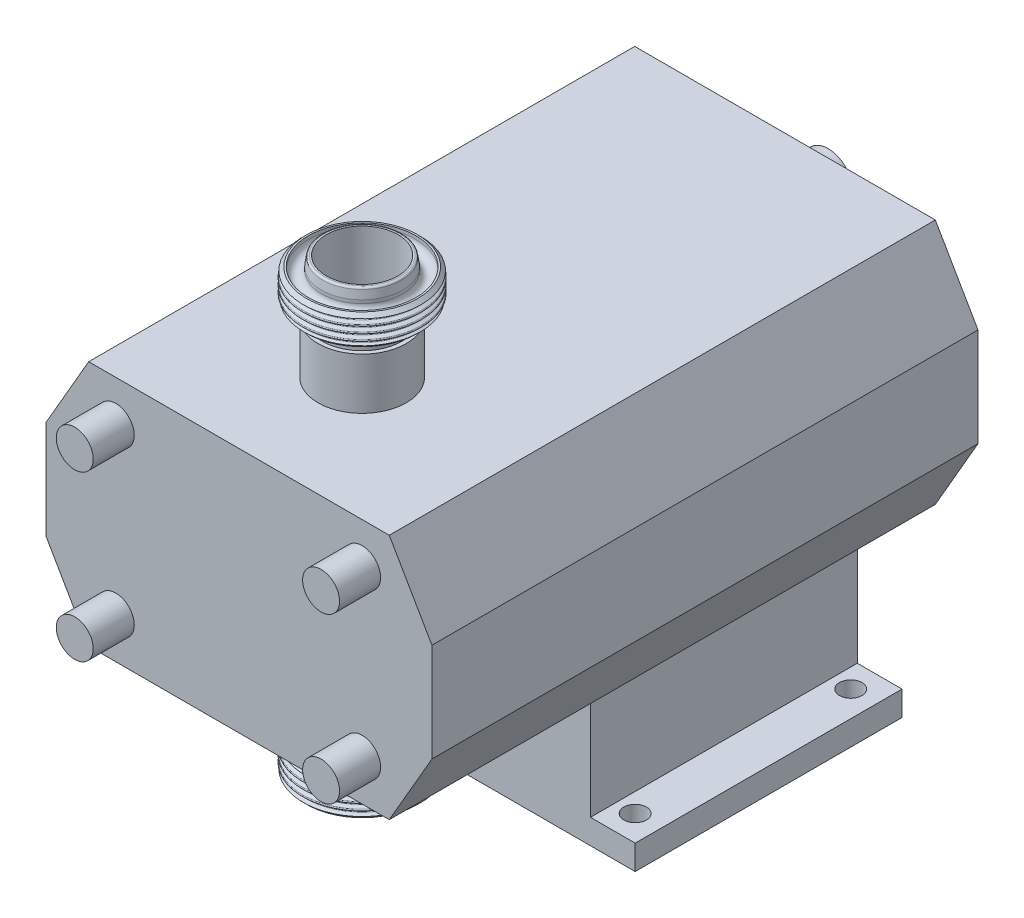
ISO-10303-21;
HEADER;
FILE_DESCRIPTION(('STEP AP214'),'2;1');
FILE_NAME('part.step','',(''),(''),'','','');
FILE_SCHEMA(('AUTOMOTIVE_DESIGN { 1 0 10303 214 1 1 1 1 }'));
ENDSEC;
DATA;
#1=APPLICATION_CONTEXT('core data for automotive mechanical design processes');
#2=APPLICATION_PROTOCOL_DEFINITION('international standard','automotive_design',2000,#1);
#3=PRODUCT_CONTEXT('',#1,'mechanical');
#4=PRODUCT('Part','Part','',(#3));
#5=PRODUCT_RELATED_PRODUCT_CATEGORY('part','',(#4));
#6=PRODUCT_DEFINITION_FORMATION('','',#4);
#7=PRODUCT_DEFINITION_CONTEXT('part definition',#1,'design');
#8=PRODUCT_DEFINITION('design','',#6,#7);
#9=PRODUCT_DEFINITION_SHAPE('','',#8);
#10=(LENGTH_UNIT() NAMED_UNIT(*) SI_UNIT(.MILLI.,.METRE.));
#11=(NAMED_UNIT(*) PLANE_ANGLE_UNIT() SI_UNIT($,.RADIAN.));
#12=(NAMED_UNIT(*) SI_UNIT($,.STERADIAN.) SOLID_ANGLE_UNIT());
#13=UNCERTAINTY_MEASURE_WITH_UNIT(LENGTH_MEASURE(1.E-05),#10,'distance_accuracy_value','');
#14=(GEOMETRIC_REPRESENTATION_CONTEXT(3) GLOBAL_UNCERTAINTY_ASSIGNED_CONTEXT((#13)) GLOBAL_UNIT_ASSIGNED_CONTEXT((#10,
#11,#12)) REPRESENTATION_CONTEXT('',''));
#15=CARTESIAN_POINT('',(0.,0.,0.));
#16=DIRECTION('',(0.,0.,1.));
#17=DIRECTION('',(1.,0.,0.));
#18=AXIS2_PLACEMENT_3D('',#15,#16,#17);
#19=CARTESIAN_POINT('',(-1.25945837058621,-88.2738015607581,103.5));
#20=DIRECTION('',(0.,1.,0.));
#21=DIRECTION('',(0.959099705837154,0.,-0.283068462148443));
#22=AXIS2_PLACEMENT_3D('',#19,#20,#21);
#23=CONICAL_SURFACE('',#22,27.,0.785398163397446);
#24=CARTESIAN_POINT('',(-1.25945837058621,-88.2738015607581,103.5));
#25=DIRECTION('',(0.,-1.,0.));
#26=DIRECTION('',(-0.959099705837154,0.,0.283068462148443));
#27=AXIS2_PLACEMENT_3D('',#24,#25,#26);
#28=CIRCLE('',#27,27.);
#29=CARTESIAN_POINT('',(-27.1551504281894,-88.2738015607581,111.142848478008));
#30=VERTEX_POINT('',#29);
#31=EDGE_CURVE('P0_E52',#30,#30,#28,.T.);
#32=ORIENTED_EDGE('',*,*,#31,.F.);
#33=EDGE_LOOP('',(#32));
#34=FACE_BOUND('',#33,.T.);
#35=CARTESIAN_POINT('',(-1.25945837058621,-86.5683816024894,103.5));
#36=DIRECTION('',(0.,-1.,0.));
#37=DIRECTION('',(-0.959099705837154,0.,0.283068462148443));
#38=AXIS2_PLACEMENT_3D('',#35,#36,#37);
#39=CIRCLE('',#38,28.7054199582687);
#40=CARTESIAN_POINT('',(-28.7908182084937,-86.5683816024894,111.625599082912));
#41=VERTEX_POINT('',#40);
#42=EDGE_CURVE('P0_E18',#41,#41,#39,.T.);
#43=ORIENTED_EDGE('',*,*,#42,.T.);
#44=EDGE_LOOP('',(#43));
#45=FACE_BOUND('',#44,.T.);
#46=ADVANCED_FACE('P0_F14',(#34,#45),#23,.T.);
#47=CARTESIAN_POINT('',(-1.25945837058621,-75.5738015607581,103.5));
#48=DIRECTION('',(0.,-1.,0.));
#49=DIRECTION('',(-0.959099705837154,0.,0.283068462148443));
#50=AXIS2_PLACEMENT_3D('',#47,#48,#49);
#51=CONICAL_SURFACE('',#50,29.,0.785398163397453);
#52=CARTESIAN_POINT('',(-1.25945837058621,-73.5738015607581,103.5));
#53=DIRECTION('',(0.,-1.,0.));
#54=DIRECTION('',(-0.959099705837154,0.,0.283068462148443));
#55=AXIS2_PLACEMENT_3D('',#52,#53,#54);
#56=CIRCLE('',#55,27.);
#57=CARTESIAN_POINT('',(-27.1551504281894,-73.5738015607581,111.142848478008));
#58=VERTEX_POINT('',#57);
#59=EDGE_CURVE('P0_E49',#58,#58,#56,.T.);
#60=ORIENTED_EDGE('',*,*,#59,.T.);
#61=EDGE_LOOP('',(#60));
#62=FACE_BOUND('',#61,.T.);
#63=CARTESIAN_POINT('',(-1.25945837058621,-74.901073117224,103.5));
#64=DIRECTION('',(0.,1.,0.));
#65=DIRECTION('',(0.959099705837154,0.,-0.283068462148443));
#66=AXIS2_PLACEMENT_3D('',#63,#64,#65);
#67=CIRCLE('',#66,28.327271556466);
#68=CARTESIAN_POINT('',(25.9092194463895,-74.901073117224,95.4814428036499));
#69=VERTEX_POINT('',#68);
#70=EDGE_CURVE('P0_E30',#69,#69,#67,.T.);
#71=ORIENTED_EDGE('',*,*,#70,.T.);
#72=EDGE_LOOP('',(#71));
#73=FACE_BOUND('',#72,.T.);
#74=ADVANCED_FACE('P0_F97',(#62,#73),#51,.T.);
#75=CARTESIAN_POINT('',(-1.25945837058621,-71.0738015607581,103.5));
#76=DIRECTION('',(0.,-1.,0.));
#77=DIRECTION('',(-0.959099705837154,0.,0.283068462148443));
#78=AXIS2_PLACEMENT_3D('',#75,#76,#77);
#79=TOROIDAL_SURFACE('',#78,22.,2.5);
#80=CARTESIAN_POINT('',(-1.25945837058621,-71.0738015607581,103.5));
#81=DIRECTION('',(0.,-1.,0.));
#82=DIRECTION('',(-0.959099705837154,0.,0.283068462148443));
#83=AXIS2_PLACEMENT_3D('',#80,#81,#82);
#84=CIRCLE('',#83,19.5);
#85=CARTESIAN_POINT('',(-19.9619026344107,-71.0738015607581,109.019835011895));
#86=VERTEX_POINT('',#85);
#87=EDGE_CURVE('P0_E9',#86,#86,#84,.T.);
#88=ORIENTED_EDGE('',*,*,#87,.T.);
#89=EDGE_LOOP('',(#88));
#90=FACE_BOUND('',#89,.T.);
#91=CARTESIAN_POINT('',(-1.25945837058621,-73.5738015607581,103.5));
#92=DIRECTION('',(0.,-1.,0.));
#93=DIRECTION('',(-0.959099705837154,0.,0.283068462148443));
#94=AXIS2_PLACEMENT_3D('',#91,#92,#93);
#95=CIRCLE('',#94,22.);
#96=CARTESIAN_POINT('',(-22.3596518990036,-73.5738015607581,109.727506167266));
#97=VERTEX_POINT('',#96);
#98=EDGE_CURVE('P0_E36',#97,#97,#95,.T.);
#99=ORIENTED_EDGE('',*,*,#98,.F.);
#100=EDGE_LOOP('',(#99));
#101=FACE_BOUND('',#100,.T.);
#102=ADVANCED_FACE('P0_F16',(#90,#101),#79,.F.);
#103=CARTESIAN_POINT('',(-1.25945837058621,-104.295031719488,103.5));
#104=DIRECTION('',(0.,-1.,0.));
#105=DIRECTION('',(-0.959099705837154,0.,0.283068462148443));
#106=AXIS2_PLACEMENT_3D('',#103,#104,#105);
#107=CYLINDRICAL_SURFACE('',#106,19.5);
#108=CARTESIAN_POINT('',(-1.25945837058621,-66.5738015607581,103.5));
#109=DIRECTION('',(0.,-1.,0.));
#110=DIRECTION('',(-0.959099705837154,0.,0.283068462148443));
#111=AXIS2_PLACEMENT_3D('',#108,#109,#110);
#112=CIRCLE('',#111,19.5);
#113=CARTESIAN_POINT('',(-19.9619026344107,-66.5738015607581,109.019835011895));
#114=VERTEX_POINT('',#113);
#115=EDGE_CURVE('P0_E22',#114,#114,#112,.T.);
#116=ORIENTED_EDGE('',*,*,#115,.T.);
#117=EDGE_LOOP('',(#116));
#118=FACE_BOUND('',#117,.T.);
#119=ORIENTED_EDGE('',*,*,#87,.F.);
#120=EDGE_LOOP('',(#119));
#121=FACE_BOUND('',#120,.T.);
#122=ADVANCED_FACE('P0_F94',(#118,#121),#107,.T.);
#123=CARTESIAN_POINT('',(3.68008629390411,-66.5738015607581,120.236289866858));
#124=DIRECTION('',(0.,1.,0.));
#125=DIRECTION('',(0.959099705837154,0.,-0.283068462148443));
#126=AXIS2_PLACEMENT_3D('',#123,#124,#125);
#127=PLANE('',#126);
#128=CARTESIAN_POINT('',(-1.25945837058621,-66.5738015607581,103.5));
#129=DIRECTION('',(0.,-1.,0.));
#130=DIRECTION('',(-0.959099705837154,0.,0.283068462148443));
#131=AXIS2_PLACEMENT_3D('',#128,#129,#130);
#132=CIRCLE('',#131,17.45);
#133=CARTESIAN_POINT('',(-17.9957482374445,-66.5738015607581,108.43954466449));
#134=VERTEX_POINT('',#133);
#135=EDGE_CURVE('P0_E27',#134,#134,#132,.T.);
#136=ORIENTED_EDGE('',*,*,#135,.T.);
#137=EDGE_LOOP('',(#136));
#138=FACE_BOUND('',#137,.T.);
#139=ORIENTED_EDGE('',*,*,#115,.F.);
#140=EDGE_LOOP('',(#139));
#141=FACE_BOUND('',#140,.T.);
#142=ADVANCED_FACE('P0_F78',(#138,#141),#127,.T.);
#143=CARTESIAN_POINT('',(-1.25945837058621,-104.295031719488,103.5));
#144=DIRECTION('',(0.,-1.,0.));
#145=DIRECTION('',(-0.959099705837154,0.,0.283068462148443));
#146=AXIS2_PLACEMENT_3D('',#143,#144,#145);
#147=CYLINDRICAL_SURFACE('',#146,17.45);
#148=CARTESIAN_POINT('',(-1.25945837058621,-93.0738015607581,103.5));
#149=DIRECTION('',(0.,-1.,0.));
#150=DIRECTION('',(-0.959099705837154,0.,0.283068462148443));
#151=AXIS2_PLACEMENT_3D('',#148,#149,#150);
#152=CIRCLE('',#151,17.45);
#153=CARTESIAN_POINT('',(-17.9957482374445,-93.0738015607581,108.43954466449));
#154=VERTEX_POINT('',#153);
#155=EDGE_CURVE('P0_E73',#154,#154,#152,.T.);
#156=ORIENTED_EDGE('',*,*,#155,.T.);
#157=EDGE_LOOP('',(#156));
#158=FACE_BOUND('',#157,.T.);
#159=ORIENTED_EDGE('',*,*,#135,.F.);
#160=EDGE_LOOP('',(#159));
#161=FACE_BOUND('',#160,.T.);
#162=ADVANCED_FACE('P0_F81',(#158,#161),#147,.F.);
#163=CARTESIAN_POINT('',(3.89832643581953,-93.0738015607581,120.975736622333));
#164=DIRECTION('',(0.,-1.,0.));
#165=DIRECTION('',(-0.959099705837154,0.,0.283068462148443));
#166=AXIS2_PLACEMENT_3D('',#163,#164,#165);
#167=PLANE('',#166);
#168=CARTESIAN_POINT('',(-1.25945837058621,-93.0738015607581,103.5));
#169=DIRECTION('',(0.,-1.,0.));
#170=DIRECTION('',(-0.959099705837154,0.,0.283068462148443));
#171=AXIS2_PLACEMENT_3D('',#168,#169,#170);
#172=CIRCLE('',#171,18.2209800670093);
#173=CARTESIAN_POINT('',(-18.7351949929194,-93.0738015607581,108.657784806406));
#174=VERTEX_POINT('',#173);
#175=EDGE_CURVE('P0_E70',#174,#174,#172,.T.);
#176=ORIENTED_EDGE('',*,*,#175,.T.);
#177=EDGE_LOOP('',(#176));
#178=FACE_BOUND('',#177,.T.);
#179=ORIENTED_EDGE('',*,*,#155,.F.);
#180=EDGE_LOOP('',(#179));
#181=FACE_BOUND('',#180,.T.);
#182=ADVANCED_FACE('P0_F83',(#178,#181),#167,.T.);
#183=CARTESIAN_POINT('',(-1.25945837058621,-92.0738015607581,103.5));
#184=DIRECTION('',(0.,-1.,0.));
#185=DIRECTION('',(-0.959099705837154,0.,0.283068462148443));
#186=AXIS2_PLACEMENT_3D('',#183,#184,#185);
#187=TOROIDAL_SURFACE('',#186,18.2209800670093,1.);
#188=CARTESIAN_POINT('',(-1.25945837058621,-92.2216109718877,103.5));
#189=DIRECTION('',(0.,-1.,0.));
#190=DIRECTION('',(-0.959099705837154,0.,0.283068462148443));
#191=AXIS2_PLACEMENT_3D('',#188,#189,#190);
#192=CIRCLE('',#191,19.2099959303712);
#193=CARTESIAN_POINT('',(-19.6837598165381,-92.2216109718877,108.937744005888));
#194=VERTEX_POINT('',#193);
#195=EDGE_CURVE('P0_E67',#194,#194,#192,.T.);
#196=ORIENTED_EDGE('',*,*,#195,.T.);
#197=EDGE_LOOP('',(#196));
#198=FACE_BOUND('',#197,.T.);
#199=ORIENTED_EDGE('',*,*,#175,.F.);
#200=EDGE_LOOP('',(#199));
#201=FACE_BOUND('',#200,.T.);
#202=ADVANCED_FACE('P0_F91',(#198,#201),#187,.T.);
#203=CARTESIAN_POINT('',(-1.25945837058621,-92.2216109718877,103.5));
#204=DIRECTION('',(0.,1.,0.));
#205=DIRECTION('',(0.959099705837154,0.,-0.283068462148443));
#206=AXIS2_PLACEMENT_3D('',#203,#204,#205);
#207=CONICAL_SURFACE('',#206,19.2099959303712,0.148352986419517);
#208=CARTESIAN_POINT('',(-1.25945837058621,-88.2738015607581,103.5));
#209=DIRECTION('',(0.,-1.,0.));
#210=DIRECTION('',(-0.959099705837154,0.,0.283068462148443));
#211=AXIS2_PLACEMENT_3D('',#208,#209,#210);
#212=CIRCLE('',#211,19.8);
#213=CARTESIAN_POINT('',(-20.2496325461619,-88.2738015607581,109.104755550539));
#214=VERTEX_POINT('',#213);
#215=EDGE_CURVE('P0_E64',#214,#214,#212,.T.);
#216=ORIENTED_EDGE('',*,*,#215,.T.);
#217=EDGE_LOOP('',(#216));
#218=FACE_BOUND('',#217,.T.);
#219=ORIENTED_EDGE('',*,*,#195,.F.);
#220=EDGE_LOOP('',(#219));
#221=FACE_BOUND('',#220,.T.);
#222=ADVANCED_FACE('P0_F125',(#218,#221),#207,.T.);
#223=CARTESIAN_POINT('',(-1.25945837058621,-104.295031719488,103.5));
#224=DIRECTION('',(0.,-1.,0.));
#225=DIRECTION('',(-0.959099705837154,0.,0.283068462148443));
#226=AXIS2_PLACEMENT_3D('',#223,#224,#225);
#227=CYLINDRICAL_SURFACE('',#226,19.8);
#228=CARTESIAN_POINT('',(-1.25945837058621,-86.6738015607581,103.5));
#229=DIRECTION('',(0.,-1.,0.));
#230=DIRECTION('',(-0.959099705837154,0.,0.283068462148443));
#231=AXIS2_PLACEMENT_3D('',#228,#229,#230);
#232=CIRCLE('',#231,19.8);
#233=CARTESIAN_POINT('',(-20.2496325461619,-86.6738015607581,109.104755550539));
#234=VERTEX_POINT('',#233);
#235=EDGE_CURVE('P0_E61',#234,#234,#232,.T.);
#236=ORIENTED_EDGE('',*,*,#235,.T.);
#237=EDGE_LOOP('',(#236));
#238=FACE_BOUND('',#237,.T.);
#239=ORIENTED_EDGE('',*,*,#215,.F.);
#240=EDGE_LOOP('',(#239));
#241=FACE_BOUND('',#240,.T.);
#242=ADVANCED_FACE('P0_F121',(#238,#241),#227,.T.);
#243=CARTESIAN_POINT('',(-1.25945837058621,-86.6738015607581,103.5));
#244=DIRECTION('',(0.,-1.,0.));
#245=DIRECTION('',(-0.959099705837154,0.,0.283068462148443));
#246=AXIS2_PLACEMENT_3D('',#243,#244,#245);
#247=TOROIDAL_SURFACE('',#246,22.975,3.175);
#248=CARTESIAN_POINT('',(-1.25945837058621,-86.6738015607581,103.5));
#249=DIRECTION('',(0.,-1.,0.));
#250=DIRECTION('',(-0.959099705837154,0.,0.283068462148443));
#251=AXIS2_PLACEMENT_3D('',#248,#249,#250);
#252=CIRCLE('',#251,26.15);
#253=CARTESIAN_POINT('',(-26.3399156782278,-86.6738015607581,110.902240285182));
#254=VERTEX_POINT('',#253);
#255=EDGE_CURVE('P0_E58',#254,#254,#252,.T.);
#256=ORIENTED_EDGE('',*,*,#255,.T.);
#257=EDGE_LOOP('',(#256));
#258=FACE_BOUND('',#257,.T.);
#259=ORIENTED_EDGE('',*,*,#235,.F.);
#260=EDGE_LOOP('',(#259));
#261=FACE_BOUND('',#260,.T.);
#262=ADVANCED_FACE('P0_F117',(#258,#261),#247,.F.);
#263=CARTESIAN_POINT('',(-1.25945837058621,-104.295031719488,103.5));
#264=DIRECTION('',(0.,-1.,0.));
#265=DIRECTION('',(-0.959099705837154,0.,0.283068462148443));
#266=AXIS2_PLACEMENT_3D('',#263,#264,#265);
#267=CYLINDRICAL_SURFACE('',#266,26.15);
#268=CARTESIAN_POINT('',(-1.25945837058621,-88.2738015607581,103.5));
#269=DIRECTION('',(0.,-1.,0.));
#270=DIRECTION('',(-0.959099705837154,0.,0.283068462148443));
#271=AXIS2_PLACEMENT_3D('',#268,#269,#270);
#272=CIRCLE('',#271,26.15);
#273=CARTESIAN_POINT('',(-26.3399156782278,-88.2738015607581,110.902240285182));
#274=VERTEX_POINT('',#273);
#275=EDGE_CURVE('P0_E55',#274,#274,#272,.T.);
#276=ORIENTED_EDGE('',*,*,#275,.T.);
#277=EDGE_LOOP('',(#276));
#278=FACE_BOUND('',#277,.T.);
#279=ORIENTED_EDGE('',*,*,#255,.F.);
#280=EDGE_LOOP('',(#279));
#281=FACE_BOUND('',#280,.T.);
#282=ADVANCED_FACE('P0_F113',(#278,#281),#267,.F.);
#283=CARTESIAN_POINT('',(6.38339010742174,-88.2738015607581,129.395692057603));
#284=DIRECTION('',(0.,-1.,0.));
#285=DIRECTION('',(-0.959099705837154,0.,0.283068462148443));
#286=AXIS2_PLACEMENT_3D('',#283,#284,#285);
#287=PLANE('',#286);
#288=ORIENTED_EDGE('',*,*,#31,.T.);
#289=EDGE_LOOP('',(#288));
#290=FACE_BOUND('',#289,.T.);
#291=ORIENTED_EDGE('',*,*,#275,.F.);
#292=EDGE_LOOP('',(#291));
#293=FACE_BOUND('',#292,.T.);
#294=ADVANCED_FACE('P0_F109',(#290,#293),#287,.T.);
#295=CARTESIAN_POINT('',(4.96804779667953,-73.5738015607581,124.600193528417));
#296=DIRECTION('',(0.,1.,0.));
#297=DIRECTION('',(0.959099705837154,0.,-0.283068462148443));
#298=AXIS2_PLACEMENT_3D('',#295,#296,#297);
#299=PLANE('',#298);
#300=ORIENTED_EDGE('',*,*,#98,.T.);
#301=EDGE_LOOP('',(#300));
#302=FACE_BOUND('',#301,.T.);
#303=ORIENTED_EDGE('',*,*,#59,.F.);
#304=EDGE_LOOP('',(#303));
#305=FACE_BOUND('',#304,.T.);
#306=ADVANCED_FACE('P0_F112',(#302,#305),#299,.T.);
#307=CARTESIAN_POINT('',(-1.25945837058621,-83.8113015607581,103.5));
#308=DIRECTION('',(0.,-1.,0.));
#309=DIRECTION('',(-0.959099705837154,0.,0.283068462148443));
#310=AXIS2_PLACEMENT_3D('',#307,#308,#309);
#311=TOROIDAL_SURFACE('',#310,28.564,0.435999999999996);
#312=CARTESIAN_POINT('',(-1.25945837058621,-84.1980382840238,103.5));
#313=DIRECTION('',(0.,-1.,0.));
#314=DIRECTION('',(-0.959099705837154,0.,0.283068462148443));
#315=AXIS2_PLACEMENT_3D('',#312,#313,#314);
#316=CIRCLE('',#315,28.7653223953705);
#317=CARTESIAN_POINT('',(-28.8482706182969,-84.1980382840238,111.642555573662));
#318=VERTEX_POINT('',#317);
#319=EDGE_CURVE('P0_E43',#318,#318,#316,.T.);
#320=ORIENTED_EDGE('',*,*,#319,.F.);
#321=EDGE_LOOP('',(#320));
#322=FACE_BOUND('',#321,.T.);
#323=CARTESIAN_POINT('',(-1.25945837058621,-83.4245648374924,103.5));
#324=DIRECTION('',(0.,-1.,0.));
#325=DIRECTION('',(-0.959099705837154,0.,0.283068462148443));
#326=AXIS2_PLACEMENT_3D('',#323,#324,#325);
#327=CIRCLE('',#326,28.7653223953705);
#328=CARTESIAN_POINT('',(-28.848270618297,-83.4245648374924,111.642555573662));
#329=VERTEX_POINT('',#328);
#330=EDGE_CURVE('P0_E328',#329,#329,#327,.T.);
#331=ORIENTED_EDGE('',*,*,#330,.T.);
#332=EDGE_LOOP('',(#331));
#333=FACE_BOUND('',#332,.T.);
#334=ADVANCED_FACE('P0_F171',(#322,#333),#311,.T.);
#335=CARTESIAN_POINT('',(-1.25945837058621,-80.6363015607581,103.5));
#336=DIRECTION('',(0.,-1.,0.));
#337=DIRECTION('',(-0.959099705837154,0.,0.283068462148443));
#338=AXIS2_PLACEMENT_3D('',#335,#336,#337);
#339=TOROIDAL_SURFACE('',#338,28.564,0.435999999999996);
#340=CARTESIAN_POINT('',(-1.25945837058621,-81.0230382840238,103.5));
#341=DIRECTION('',(0.,-1.,0.));
#342=DIRECTION('',(-0.959099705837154,0.,0.283068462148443));
#343=AXIS2_PLACEMENT_3D('',#340,#341,#342);
#344=CIRCLE('',#343,28.7653223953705);
#345=CARTESIAN_POINT('',(-28.8482706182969,-81.0230382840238,111.642555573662));
#346=VERTEX_POINT('',#345);
#347=EDGE_CURVE('P0_E319',#346,#346,#344,.T.);
#348=ORIENTED_EDGE('',*,*,#347,.F.);
#349=EDGE_LOOP('',(#348));
#350=FACE_BOUND('',#349,.T.);
#351=CARTESIAN_POINT('',(-1.25945837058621,-80.2495648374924,103.5));
#352=DIRECTION('',(0.,-1.,0.));
#353=DIRECTION('',(-0.959099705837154,0.,0.283068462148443));
#354=AXIS2_PLACEMENT_3D('',#351,#352,#353);
#355=CIRCLE('',#354,28.7653223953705);
#356=CARTESIAN_POINT('',(-28.848270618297,-80.2495648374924,111.642555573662));
#357=VERTEX_POINT('',#356);
#358=EDGE_CURVE('P0_E316',#357,#357,#355,.T.);
#359=ORIENTED_EDGE('',*,*,#358,.T.);
#360=EDGE_LOOP('',(#359));
#361=FACE_BOUND('',#360,.T.);
#362=ADVANCED_FACE('P0_F178',(#350,#361),#339,.T.);
#363=CARTESIAN_POINT('',(-1.25945837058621,-77.4613015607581,103.5));
#364=DIRECTION('',(0.,-1.,0.));
#365=DIRECTION('',(-0.959099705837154,0.,0.283068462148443));
#366=AXIS2_PLACEMENT_3D('',#363,#364,#365);
#367=TOROIDAL_SURFACE('',#366,28.564,0.435999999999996);
#368=CARTESIAN_POINT('',(-1.25945837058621,-77.8480382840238,103.5));
#369=DIRECTION('',(0.,-1.,0.));
#370=DIRECTION('',(-0.959099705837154,0.,0.283068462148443));
#371=AXIS2_PLACEMENT_3D('',#368,#369,#370);
#372=CIRCLE('',#371,28.7653223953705);
#373=CARTESIAN_POINT('',(-28.8482706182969,-77.8480382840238,111.642555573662));
#374=VERTEX_POINT('',#373);
#375=EDGE_CURVE('P0_E307',#374,#374,#372,.T.);
#376=ORIENTED_EDGE('',*,*,#375,.F.);
#377=EDGE_LOOP('',(#376));
#378=FACE_BOUND('',#377,.T.);
#379=CARTESIAN_POINT('',(-1.25945837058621,-77.0745648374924,103.5));
#380=DIRECTION('',(0.,-1.,0.));
#381=DIRECTION('',(-0.959099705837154,0.,0.283068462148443));
#382=AXIS2_PLACEMENT_3D('',#379,#380,#381);
#383=CIRCLE('',#382,28.7653223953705);
#384=CARTESIAN_POINT('',(-28.848270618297,-77.0745648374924,111.642555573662));
#385=VERTEX_POINT('',#384);
#386=EDGE_CURVE('P0_E302',#385,#385,#383,.T.);
#387=ORIENTED_EDGE('',*,*,#386,.T.);
#388=EDGE_LOOP('',(#387));
#389=FACE_BOUND('',#388,.T.);
#390=ADVANCED_FACE('P0_F186',(#378,#389),#367,.T.);
#391=CARTESIAN_POINT('',(-1.25945837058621,-86.5995648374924,103.5));
#392=DIRECTION('',(0.,-1.,0.));
#393=DIRECTION('',(-0.959099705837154,0.,0.283068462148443));
#394=AXIS2_PLACEMENT_3D('',#391,#392,#393);
#395=CONICAL_SURFACE('',#394,28.7653223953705,1.09083078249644);
#396=ORIENTED_EDGE('',*,*,#42,.F.);
#397=EDGE_LOOP('',(#396));
#398=FACE_BOUND('',#397,.T.);
#399=CARTESIAN_POINT('',(-1.25945837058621,-85.7855382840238,103.5));
#400=DIRECTION('',(0.,-1.,0.));
#401=DIRECTION('',(-0.959099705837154,0.,0.283068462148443));
#402=AXIS2_PLACEMENT_3D('',#399,#400,#401);
#403=CIRCLE('',#402,27.2015919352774);
#404=CARTESIAN_POINT('',(-27.3484971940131,-85.7855382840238,111.199912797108));
#405=VERTEX_POINT('',#404);
#406=EDGE_CURVE('P0_E32',#405,#405,#403,.T.);
#407=ORIENTED_EDGE('',*,*,#406,.T.);
#408=EDGE_LOOP('',(#407));
#409=FACE_BOUND('',#408,.T.);
#410=ADVANCED_FACE('P0_F194',(#398,#409),#395,.T.);
#411=CARTESIAN_POINT('',(-1.25945837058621,-85.3988015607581,103.5));
#412=DIRECTION('',(0.,-1.,0.));
#413=DIRECTION('',(-0.959099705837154,0.,0.283068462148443));
#414=AXIS2_PLACEMENT_3D('',#411,#412,#413);
#415=TOROIDAL_SURFACE('',#414,27.4029143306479,0.436000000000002);
#416=CARTESIAN_POINT('',(-1.25945837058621,-85.0120648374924,103.5));
#417=DIRECTION('',(0.,-1.,0.));
#418=DIRECTION('',(-0.959099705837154,0.,0.283068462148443));
#419=AXIS2_PLACEMENT_3D('',#416,#417,#418);
#420=CIRCLE('',#419,27.2015919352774);
#421=CARTESIAN_POINT('',(-27.3484971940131,-85.0120648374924,111.199912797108));
#422=VERTEX_POINT('',#421);
#423=EDGE_CURVE('P0_E38',#422,#422,#420,.T.);
#424=ORIENTED_EDGE('',*,*,#423,.T.);
#425=EDGE_LOOP('',(#424));
#426=FACE_BOUND('',#425,.T.);
#427=ORIENTED_EDGE('',*,*,#406,.F.);
#428=EDGE_LOOP('',(#427));
#429=FACE_BOUND('',#428,.T.);
#430=ADVANCED_FACE('P0_F202',(#426,#429),#415,.F.);
#431=CARTESIAN_POINT('',(-1.25945837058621,-85.0120648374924,103.5));
#432=DIRECTION('',(0.,1.,0.));
#433=DIRECTION('',(0.959099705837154,0.,-0.283068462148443));
#434=AXIS2_PLACEMENT_3D('',#431,#432,#433);
#435=CONICAL_SURFACE('',#434,27.2015919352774,1.09083078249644);
#436=ORIENTED_EDGE('',*,*,#319,.T.);
#437=EDGE_LOOP('',(#436));
#438=FACE_BOUND('',#437,.T.);
#439=ORIENTED_EDGE('',*,*,#423,.F.);
#440=EDGE_LOOP('',(#439));
#441=FACE_BOUND('',#440,.T.);
#442=ADVANCED_FACE('P0_F210',(#438,#441),#435,.T.);
#443=CARTESIAN_POINT('',(-1.25945837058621,-83.4245648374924,103.5));
#444=DIRECTION('',(0.,-1.,0.));
#445=DIRECTION('',(-0.959099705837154,0.,0.283068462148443));
#446=AXIS2_PLACEMENT_3D('',#443,#444,#445);
#447=CONICAL_SURFACE('',#446,28.7653223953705,1.09083078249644);
#448=CARTESIAN_POINT('',(-1.25945837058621,-82.6105382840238,103.5));
#449=DIRECTION('',(0.,-1.,0.));
#450=DIRECTION('',(-0.959099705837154,0.,0.283068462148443));
#451=AXIS2_PLACEMENT_3D('',#448,#449,#450);
#452=CIRCLE('',#451,27.2015919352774);
#453=CARTESIAN_POINT('',(-27.3484971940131,-82.6105382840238,111.199912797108));
#454=VERTEX_POINT('',#453);
#455=EDGE_CURVE('P0_E325',#454,#454,#452,.T.);
#456=ORIENTED_EDGE('',*,*,#455,.T.);
#457=EDGE_LOOP('',(#456));
#458=FACE_BOUND('',#457,.T.);
#459=ORIENTED_EDGE('',*,*,#330,.F.);
#460=EDGE_LOOP('',(#459));
#461=FACE_BOUND('',#460,.T.);
#462=ADVANCED_FACE('P0_F218',(#458,#461),#447,.T.);
#463=CARTESIAN_POINT('',(-1.25945837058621,-82.2238015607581,103.5));
#464=DIRECTION('',(0.,-1.,0.));
#465=DIRECTION('',(-0.959099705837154,0.,0.283068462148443));
#466=AXIS2_PLACEMENT_3D('',#463,#464,#465);
#467=TOROIDAL_SURFACE('',#466,27.4029143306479,0.436000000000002);
#468=CARTESIAN_POINT('',(-1.25945837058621,-81.8370648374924,103.5));
#469=DIRECTION('',(0.,-1.,0.));
#470=DIRECTION('',(-0.959099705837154,0.,0.283068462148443));
#471=AXIS2_PLACEMENT_3D('',#468,#469,#470);
#472=CIRCLE('',#471,27.2015919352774);
#473=CARTESIAN_POINT('',(-27.3484971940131,-81.8370648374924,111.199912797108));
#474=VERTEX_POINT('',#473);
#475=EDGE_CURVE('P0_E322',#474,#474,#472,.T.);
#476=ORIENTED_EDGE('',*,*,#475,.T.);
#477=EDGE_LOOP('',(#476));
#478=FACE_BOUND('',#477,.T.);
#479=ORIENTED_EDGE('',*,*,#455,.F.);
#480=EDGE_LOOP('',(#479));
#481=FACE_BOUND('',#480,.T.);
#482=ADVANCED_FACE('P0_F226',(#478,#481),#467,.F.);
#483=CARTESIAN_POINT('',(-1.25945837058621,-81.8370648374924,103.5));
#484=DIRECTION('',(0.,1.,0.));
#485=DIRECTION('',(0.959099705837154,0.,-0.283068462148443));
#486=AXIS2_PLACEMENT_3D('',#483,#484,#485);
#487=CONICAL_SURFACE('',#486,27.2015919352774,1.09083078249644);
#488=ORIENTED_EDGE('',*,*,#347,.T.);
#489=EDGE_LOOP('',(#488));
#490=FACE_BOUND('',#489,.T.);
#491=ORIENTED_EDGE('',*,*,#475,.F.);
#492=EDGE_LOOP('',(#491));
#493=FACE_BOUND('',#492,.T.);
#494=ADVANCED_FACE('P0_F234',(#490,#493),#487,.T.);
#495=CARTESIAN_POINT('',(-1.25945837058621,-80.2495648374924,103.5));
#496=DIRECTION('',(0.,-1.,0.));
#497=DIRECTION('',(-0.959099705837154,0.,0.283068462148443));
#498=AXIS2_PLACEMENT_3D('',#495,#496,#497);
#499=CONICAL_SURFACE('',#498,28.7653223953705,1.09083078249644);
#500=CARTESIAN_POINT('',(-1.25945837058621,-79.4355382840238,103.5));
#501=DIRECTION('',(0.,-1.,0.));
#502=DIRECTION('',(-0.959099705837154,0.,0.283068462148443));
#503=AXIS2_PLACEMENT_3D('',#500,#501,#502);
#504=CIRCLE('',#503,27.2015919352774);
#505=CARTESIAN_POINT('',(-27.3484971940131,-79.4355382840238,111.199912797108));
#506=VERTEX_POINT('',#505);
#507=EDGE_CURVE('P0_E313',#506,#506,#504,.T.);
#508=ORIENTED_EDGE('',*,*,#507,.T.);
#509=EDGE_LOOP('',(#508));
#510=FACE_BOUND('',#509,.T.);
#511=ORIENTED_EDGE('',*,*,#358,.F.);
#512=EDGE_LOOP('',(#511));
#513=FACE_BOUND('',#512,.T.);
#514=ADVANCED_FACE('P0_F242',(#510,#513),#499,.T.);
#515=CARTESIAN_POINT('',(-1.25945837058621,-79.0488015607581,103.5));
#516=DIRECTION('',(0.,-1.,0.));
#517=DIRECTION('',(-0.959099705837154,0.,0.283068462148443));
#518=AXIS2_PLACEMENT_3D('',#515,#516,#517);
#519=TOROIDAL_SURFACE('',#518,27.4029143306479,0.436000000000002);
#520=CARTESIAN_POINT('',(-1.25945837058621,-78.6620648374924,103.5));
#521=DIRECTION('',(0.,-1.,0.));
#522=DIRECTION('',(-0.959099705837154,0.,0.283068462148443));
#523=AXIS2_PLACEMENT_3D('',#520,#521,#522);
#524=CIRCLE('',#523,27.2015919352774);
#525=CARTESIAN_POINT('',(-27.3484971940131,-78.6620648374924,111.199912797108));
#526=VERTEX_POINT('',#525);
#527=EDGE_CURVE('P0_E310',#526,#526,#524,.T.);
#528=ORIENTED_EDGE('',*,*,#527,.T.);
#529=EDGE_LOOP('',(#528));
#530=FACE_BOUND('',#529,.T.);
#531=ORIENTED_EDGE('',*,*,#507,.F.);
#532=EDGE_LOOP('',(#531));
#533=FACE_BOUND('',#532,.T.);
#534=ADVANCED_FACE('P0_F250',(#530,#533),#519,.F.);
#535=CARTESIAN_POINT('',(-1.25945837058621,-78.6620648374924,103.5));
#536=DIRECTION('',(0.,1.,0.));
#537=DIRECTION('',(0.959099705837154,0.,-0.283068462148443));
#538=AXIS2_PLACEMENT_3D('',#535,#536,#537);
#539=CONICAL_SURFACE('',#538,27.2015919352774,1.09083078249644);
#540=ORIENTED_EDGE('',*,*,#375,.T.);
#541=EDGE_LOOP('',(#540));
#542=FACE_BOUND('',#541,.T.);
#543=ORIENTED_EDGE('',*,*,#527,.F.);
#544=EDGE_LOOP('',(#543));
#545=FACE_BOUND('',#544,.T.);
#546=ADVANCED_FACE('P0_F258',(#542,#545),#539,.T.);
#547=CARTESIAN_POINT('',(-1.25945837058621,-77.0745648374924,103.5));
#548=DIRECTION('',(0.,-1.,0.));
#549=DIRECTION('',(-0.959099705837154,0.,0.283068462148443));
#550=AXIS2_PLACEMENT_3D('',#547,#548,#549);
#551=CONICAL_SURFACE('',#550,28.7653223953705,1.09083078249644);
#552=CARTESIAN_POINT('',(-1.25945837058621,-76.2605382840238,103.5));
#553=DIRECTION('',(0.,-1.,0.));
#554=DIRECTION('',(-0.959099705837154,0.,0.283068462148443));
#555=AXIS2_PLACEMENT_3D('',#552,#553,#554);
#556=CIRCLE('',#555,27.2015919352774);
#557=CARTESIAN_POINT('',(-27.3484971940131,-76.2605382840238,111.199912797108));
#558=VERTEX_POINT('',#557);
#559=EDGE_CURVE('P0_E299',#558,#558,#556,.T.);
#560=ORIENTED_EDGE('',*,*,#559,.T.);
#561=EDGE_LOOP('',(#560));
#562=FACE_BOUND('',#561,.T.);
#563=ORIENTED_EDGE('',*,*,#386,.F.);
#564=EDGE_LOOP('',(#563));
#565=FACE_BOUND('',#564,.T.);
#566=ADVANCED_FACE('P0_F266',(#562,#565),#551,.T.);
#567=CARTESIAN_POINT('',(-1.25945837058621,-75.8738015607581,103.5));
#568=DIRECTION('',(0.,-1.,0.));
#569=DIRECTION('',(-0.959099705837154,0.,0.283068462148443));
#570=AXIS2_PLACEMENT_3D('',#567,#568,#569);
#571=TOROIDAL_SURFACE('',#570,27.4029143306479,0.436000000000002);
#572=CARTESIAN_POINT('',(-1.25945837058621,-75.4870648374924,103.5));
#573=DIRECTION('',(0.,-1.,0.));
#574=DIRECTION('',(-0.959099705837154,0.,0.283068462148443));
#575=AXIS2_PLACEMENT_3D('',#572,#573,#574);
#576=CIRCLE('',#575,27.2015919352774);
#577=CARTESIAN_POINT('',(-27.3484971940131,-75.4870648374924,111.199912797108));
#578=VERTEX_POINT('',#577);
#579=EDGE_CURVE('P0_E298',#578,#578,#576,.T.);
#580=ORIENTED_EDGE('',*,*,#579,.T.);
#581=EDGE_LOOP('',(#580));
#582=FACE_BOUND('',#581,.T.);
#583=ORIENTED_EDGE('',*,*,#559,.F.);
#584=EDGE_LOOP('',(#583));
#585=FACE_BOUND('',#584,.T.);
#586=ADVANCED_FACE('P0_F274',(#582,#585),#571,.F.);
#587=CARTESIAN_POINT('',(-1.25945837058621,-75.4870648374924,103.5));
#588=DIRECTION('',(0.,1.,0.));
#589=DIRECTION('',(0.959099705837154,0.,-0.283068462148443));
#590=AXIS2_PLACEMENT_3D('',#587,#588,#589);
#591=CONICAL_SURFACE('',#590,27.2015919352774,1.09083078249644);
#592=ORIENTED_EDGE('',*,*,#70,.F.);
#593=EDGE_LOOP('',(#592));
#594=FACE_BOUND('',#593,.T.);
#595=ORIENTED_EDGE('',*,*,#579,.F.);
#596=EDGE_LOOP('',(#595));
#597=FACE_BOUND('',#596,.T.);
#598=ADVANCED_FACE('P0_F282',(#594,#597),#591,.T.);
#599=CLOSED_SHELL('',(#46,#74,#102,#122,#142,#162,#182,#202,#222,#242,#262,#282,#294,#306,#334,
#362,#390,#410,#430,#442,#462,#482,#494,#514,#534,#546,#566,#586,#598));
#600=MANIFOLD_SOLID_BREP('P0_B1',#599);
#601=CARTESIAN_POINT('',(-32.2594583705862,18.4261984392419,139.232657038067));
#602=DIRECTION('',(0.,0.,1.));
#603=DIRECTION('',(1.,0.,0.));
#604=AXIS2_PLACEMENT_3D('',#601,#602,#603);
#605=CYLINDRICAL_SURFACE('',#604,12.);
#606=CARTESIAN_POINT('',(-32.2594583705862,18.4261984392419,-104.5));
#607=DIRECTION('',(0.,0.,1.));
#608=DIRECTION('',(1.,0.,0.));
#609=AXIS2_PLACEMENT_3D('',#606,#607,#608);
#610=CIRCLE('',#609,12.);
#611=CARTESIAN_POINT('',(-20.2594583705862,18.4261984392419,-104.5));
#612=VERTEX_POINT('',#611);
#613=EDGE_CURVE('P1_E277',#612,#612,#610,.T.);
#614=ORIENTED_EDGE('',*,*,#613,.F.);
#615=EDGE_LOOP('',(#614));
#616=FACE_BOUND('',#615,.T.);
#617=DIRECTION('',(0.,0.,1.));
#618=VECTOR('',#617,1.);
#619=CARTESIAN_POINT('',(-20.9457498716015,22.4261984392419,139.232657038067));
#620=LINE('',#619,#618);
#621=CARTESIAN_POINT('',(-20.9457498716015,22.4261984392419,-154.5));
#622=VERTEX_POINT('',#621);
#623=CARTESIAN_POINT('',(-20.9457498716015,22.4261984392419,-124.5));
#624=VERTEX_POINT('',#623);
#625=EDGE_CURVE('P1_E178',#622,#624,#620,.T.);
#626=ORIENTED_EDGE('',*,*,#625,.F.);
#627=CARTESIAN_POINT('',(-32.2594583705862,18.4261984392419,-154.5));
#628=DIRECTION('',(0.,0.,1.));
#629=DIRECTION('',(1.,0.,0.));
#630=AXIS2_PLACEMENT_3D('',#627,#628,#629);
#631=CIRCLE('',#630,12.);
#632=CARTESIAN_POINT('',(-20.9457498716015,14.4261984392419,-154.5));
#633=VERTEX_POINT('',#632);
#634=EDGE_CURVE('P1_E176',#622,#633,#631,.T.);
#635=ORIENTED_EDGE('',*,*,#634,.T.);
#636=DIRECTION('',(0.,0.,1.));
#637=VECTOR('',#636,1.);
#638=CARTESIAN_POINT('',(-20.9457498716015,14.4261984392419,139.232657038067));
#639=LINE('',#638,#637);
#640=CARTESIAN_POINT('',(-20.9457498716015,14.4261984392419,-124.5));
#641=VERTEX_POINT('',#640);
#642=EDGE_CURVE('P1_E39',#641,#633,#639,.F.);
#643=ORIENTED_EDGE('',*,*,#642,.F.);
#644=CARTESIAN_POINT('',(-20.2594583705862,18.4261984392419,-128.5));
#645=CARTESIAN_POINT('',(-20.2594577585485,18.6444518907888,-128.500001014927));
#646=CARTESIAN_POINT('',(-20.2654675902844,18.8626992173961,-128.482078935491));
#647=CARTESIAN_POINT('',(-20.288849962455,19.2927654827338,-128.411083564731));
#648=CARTESIAN_POINT('',(-20.3062236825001,19.5045837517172,-128.358006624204));
#649=CARTESIAN_POINT('',(-20.3504460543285,19.915529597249,-128.218723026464));
#650=CARTESIAN_POINT('',(-20.3772788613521,20.114677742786,-128.132571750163));
#651=CARTESIAN_POINT('',(-20.4376805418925,20.4956981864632,-127.929835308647));
#652=CARTESIAN_POINT('',(-20.471250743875,20.6775670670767,-127.81324413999));
#653=CARTESIAN_POINT('',(-20.5428945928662,21.025165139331,-127.548696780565));
#654=CARTESIAN_POINT('',(-20.5810761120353,21.1902132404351,-127.399875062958));
#655=CARTESIAN_POINT('',(-20.6570457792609,21.4935292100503,-127.076931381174));
#656=CARTESIAN_POINT('',(-20.6948338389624,21.6317911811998,-126.902803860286));
#657=CARTESIAN_POINT('',(-20.7669250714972,21.8814982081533,-126.528059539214));
#658=CARTESIAN_POINT('',(-20.8010967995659,21.9920578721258,-126.326825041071));
#659=CARTESIAN_POINT('',(-20.860446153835,22.177473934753,-125.907295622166));
#660=CARTESIAN_POINT('',(-20.8856265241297,22.2523412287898,-125.689005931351));
#661=CARTESIAN_POINT('',(-20.923006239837,22.3616922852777,-125.249307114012));
#662=CARTESIAN_POINT('',(-20.9356145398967,22.3974522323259,-125.028251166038));
#663=CARTESIAN_POINT('',(-20.947632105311,22.4315629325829,-124.582944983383));
#664=CARTESIAN_POINT('',(-20.9470454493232,22.4299252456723,-124.358695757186));
#665=CARTESIAN_POINT('',(-20.9330977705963,22.3902780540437,-123.924253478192));
#666=CARTESIAN_POINT('',(-20.9203217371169,22.3539340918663,-123.713886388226));
#667=CARTESIAN_POINT('',(-20.8843920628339,22.2486230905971,-123.302426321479));
#668=CARTESIAN_POINT('',(-20.8612371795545,22.1796521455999,-123.101334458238));
#669=CARTESIAN_POINT('',(-20.8067419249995,22.009954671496,-122.710349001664));
#670=CARTESIAN_POINT('',(-20.7752757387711,21.9087346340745,-122.52068789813));
#671=CARTESIAN_POINT('',(-20.7077560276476,21.6777548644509,-122.160516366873));
#672=CARTESIAN_POINT('',(-20.6717011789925,21.5479868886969,-121.990011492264));
#673=CARTESIAN_POINT('',(-20.5967652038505,21.2555957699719,-121.663633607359));
#674=CARTESIAN_POINT('',(-20.5578347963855,21.0916110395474,-121.508989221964));
#675=CARTESIAN_POINT('',(-20.4831808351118,20.7395567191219,-121.229074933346));
#676=CARTESIAN_POINT('',(-20.4474575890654,20.5514848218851,-121.103807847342));
#677=CARTESIAN_POINT('',(-20.3827740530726,20.1539888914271,-120.88521479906));
#678=CARTESIAN_POINT('',(-20.3538843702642,19.9443715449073,-120.792218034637));
#679=CARTESIAN_POINT('',(-20.3066356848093,19.5112747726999,-120.643187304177));
#680=CARTESIAN_POINT('',(-20.2882730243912,19.2878001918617,-120.587140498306));
#681=CARTESIAN_POINT('',(-20.2647532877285,18.8437337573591,-120.515777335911));
#682=CARTESIAN_POINT('',(-20.2590582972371,18.6234368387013,-120.498800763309));
#683=CARTESIAN_POINT('',(-20.2599022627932,18.1830981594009,-120.501330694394));
#684=CARTESIAN_POINT('',(-20.2664391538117,17.9630563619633,-120.520831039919));
#685=CARTESIAN_POINT('',(-20.2906573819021,17.5361189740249,-120.594447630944));
#686=CARTESIAN_POINT('',(-20.3080104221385,17.3290272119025,-120.647544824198));
#687=CARTESIAN_POINT('',(-20.3517844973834,16.9267746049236,-120.785573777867));
#688=CARTESIAN_POINT('',(-20.3782066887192,16.7316152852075,-120.870509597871));
#689=CARTESIAN_POINT('',(-20.4383011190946,16.3530452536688,-121.072281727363));
#690=CARTESIAN_POINT('',(-20.4721457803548,16.1700786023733,-121.189898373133));
#691=CARTESIAN_POINT('',(-20.5432482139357,15.8259391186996,-121.452776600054));
#692=CARTESIAN_POINT('',(-20.5805070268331,15.6647729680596,-121.598046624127));
#693=CARTESIAN_POINT('',(-20.6563844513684,15.3611884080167,-121.919915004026));
#694=CARTESIAN_POINT('',(-20.6949879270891,15.2199545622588,-122.097636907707));
#695=CARTESIAN_POINT('',(-20.7674594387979,14.9691683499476,-122.475086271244));
#696=CARTESIAN_POINT('',(-20.8013274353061,14.8596162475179,-122.674813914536));
#697=CARTESIAN_POINT('',(-20.8601626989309,14.6758107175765,-123.09069206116));
#698=CARTESIAN_POINT('',(-20.8851479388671,14.6014859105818,-123.306808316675));
#699=CARTESIAN_POINT('',(-20.9230250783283,14.4906197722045,-123.749514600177));
#700=CARTESIAN_POINT('',(-20.9359224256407,14.4540614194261,-123.976099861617));
#701=CARTESIAN_POINT('',(-20.9475440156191,14.4210933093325,-124.420788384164));
#702=CARTESIAN_POINT('',(-20.9469623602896,14.4227174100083,-124.638729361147));
#703=CARTESIAN_POINT('',(-20.9334075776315,14.4612292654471,-125.071060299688));
#704=CARTESIAN_POINT('',(-20.9204351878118,14.4981149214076,-125.28545047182));
#705=CARTESIAN_POINT('',(-20.8840773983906,14.6047111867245,-125.70054265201));
#706=CARTESIAN_POINT('',(-20.8608944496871,14.6737850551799,-125.901427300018));
#707=CARTESIAN_POINT('',(-20.8068024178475,14.8422809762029,-126.288909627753));
#708=CARTESIAN_POINT('',(-20.7758916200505,14.9417097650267,-126.475504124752));
#709=CARTESIAN_POINT('',(-20.7081452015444,15.1731556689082,-126.837934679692));
#710=CARTESIAN_POINT('',(-20.6711099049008,15.3064054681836,-127.012946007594));
#711=CARTESIAN_POINT('',(-20.5961241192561,15.5996269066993,-127.338759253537));
#712=CARTESIAN_POINT('',(-20.5581733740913,15.759606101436,-127.489554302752));
#713=CARTESIAN_POINT('',(-20.4838571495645,16.1092322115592,-127.768577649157));
#714=CARTESIAN_POINT('',(-20.447611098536,16.299792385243,-127.895697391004));
#715=CARTESIAN_POINT('',(-20.3824187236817,16.7007690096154,-128.115961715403));
#716=CARTESIAN_POINT('',(-20.353470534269,16.9111803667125,-128.209114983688));
#717=CARTESIAN_POINT('',(-20.3072377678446,17.336223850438,-128.354886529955));
#718=CARTESIAN_POINT('',(-20.2894898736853,17.5502474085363,-128.409129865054));
#719=CARTESIAN_POINT('',(-20.2656020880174,17.9849167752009,-128.481681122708));
#720=CARTESIAN_POINT('',(-20.25945898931,18.2055607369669,-128.499998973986));
#721=CARTESIAN_POINT('',(-20.2594583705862,18.4261984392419,-128.5));
#722=B_SPLINE_CURVE_WITH_KNOTS('',3,(#644,#645,#646,#647,#648,#649,#650,#651,#652,#653,#654,
#655,#656,#657,#658,#659,#660,#661,#662,#663,#664,#665,#666,#667,#668,#669,#670,#671,#672,#673,
#674,#675,#676,#677,#678,#679,#680,#681,#682,#683,#684,#685,#686,#687,#688,#689,#690,#691,#692,
#693,#694,#695,#696,#697,#698,#699,#700,#701,#702,#703,#704,#705,#706,#707,#708,#709,#710,#711,
#712,#713,#714,#715,#716,#717,#718,#719,#720,#721),.UNSPECIFIED.,.T.,.F.,(4,2,2,2,2,2,2,2,2,2,2,
2,2,2,2,2,2,2,2,2,2,2,2,2,2,2,2,2,2,2,2,2,2,2,2,2,2,2,4),(0.,0.653948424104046,1.30796474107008,
1.96089069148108,2.61394551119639,3.28738737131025,3.96097733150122,4.65393539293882,
5.34668178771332,6.0160770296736,6.68526535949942,7.32387306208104,7.96255723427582,
8.61152684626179,9.26068410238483,9.94373223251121,10.6268458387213,11.3167362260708,
12.0063867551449,12.6661433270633,13.3257885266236,13.9663263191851,14.6069458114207,
15.264415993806,15.9220872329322,16.6096409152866,17.2972003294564,17.9833605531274,
18.6692113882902,19.3198266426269,19.9704031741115,20.6086234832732,21.2469855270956,
21.9132026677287,22.5796084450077,23.2719864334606,23.9641872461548,24.6254623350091,
25.2865546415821),.UNSPECIFIED.);
#723=EDGE_CURVE('P1_E11',#624,#641,#722,.T.);
#724=ORIENTED_EDGE('',*,*,#723,.F.);
#725=EDGE_LOOP('',(#626,#635,#643,#724));
#726=FACE_BOUND('',#725,.T.);
#727=ADVANCED_FACE('P1_F17',(#616,#726),#605,.T.);
#728=CARTESIAN_POINT('',(-74.4748486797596,-41.5738015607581,163.5));
#729=DIRECTION('',(0.,1.,0.));
#730=DIRECTION('',(-1.,0.,0.));
#731=AXIS2_PLACEMENT_3D('',#728,#729,#730);
#732=PLANE('',#731);
#733=CARTESIAN_POINT('',(-1.25945837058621,-41.5738015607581,103.5));
#734=DIRECTION('',(0.,1.,0.));
#735=DIRECTION('',(-1.,0.,0.));
#736=AXIS2_PLACEMENT_3D('',#733,#734,#735);
#737=CIRCLE('',#736,21.5);
#738=CARTESIAN_POINT('',(-22.7594583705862,-41.5738015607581,103.5));
#739=VERTEX_POINT('',#738);
#740=EDGE_CURVE('P1_E192',#739,#739,#737,.T.);
#741=ORIENTED_EDGE('',*,*,#740,.T.);
#742=EDGE_LOOP('',(#741));
#743=FACE_BOUND('',#742,.T.);
#744=DIRECTION('',(1.,0.,0.));
#745=VECTOR('',#744,1.);
#746=CARTESIAN_POINT('',(-74.4748486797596,-41.5738015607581,-102.5));
#747=LINE('',#746,#745);
#748=CARTESIAN_POINT('',(-74.4748486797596,-41.5738015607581,-102.5));
#749=VERTEX_POINT('',#748);
#750=CARTESIAN_POINT('',(71.9559319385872,-41.5738015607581,-102.5));
#751=VERTEX_POINT('',#750);
#752=EDGE_CURVE('P1_E337',#749,#751,#747,.T.);
#753=ORIENTED_EDGE('',*,*,#752,.T.);
#754=DIRECTION('',(0.,0.,-1.));
#755=VECTOR('',#754,1.);
#756=CARTESIAN_POINT('',(71.9559319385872,-41.5738015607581,163.5));
#757=LINE('',#756,#755);
#758=CARTESIAN_POINT('',(71.9559319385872,-41.5738015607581,163.5));
#759=VERTEX_POINT('',#758);
#760=EDGE_CURVE('P1_E347',#759,#751,#757,.T.);
#761=ORIENTED_EDGE('',*,*,#760,.F.);
#762=DIRECTION('',(1.,0.,0.));
#763=VECTOR('',#762,1.);
#764=CARTESIAN_POINT('',(-74.4748486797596,-41.5738015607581,163.5));
#765=LINE('',#764,#763);
#766=CARTESIAN_POINT('',(-74.4748486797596,-41.5738015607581,163.5));
#767=VERTEX_POINT('',#766);
#768=EDGE_CURVE('P1_E320',#767,#759,#765,.T.);
#769=ORIENTED_EDGE('',*,*,#768,.F.);
#770=DIRECTION('',(0.,0.,-1.));
#771=VECTOR('',#770,1.);
#772=CARTESIAN_POINT('',(-74.4748486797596,-41.5738015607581,163.5));
#773=LINE('',#772,#771);
#774=EDGE_CURVE('P1_E350',#767,#749,#773,.T.);
#775=ORIENTED_EDGE('',*,*,#774,.T.);
#776=EDGE_LOOP('',(#753,#761,#769,#775));
#777=FACE_BOUND('',#776,.T.);
#778=DIRECTION('',(1.,0.,0.));
#779=VECTOR('',#778,1.);
#780=CARTESIAN_POINT('',(51.9559319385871,-41.5738015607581,-84.5));
#781=LINE('',#780,#779);
#782=CARTESIAN_POINT('',(-54.4748486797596,-41.5738015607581,-84.5));
#783=VERTEX_POINT('',#782);
#784=CARTESIAN_POINT('',(51.9559319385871,-41.5738015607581,-84.5));
#785=VERTEX_POINT('',#784);
#786=EDGE_CURVE('P1_E220',#783,#785,#781,.T.);
#787=ORIENTED_EDGE('',*,*,#786,.F.);
#788=DIRECTION('',(0.,0.,1.));
#789=VECTOR('',#788,1.);
#790=CARTESIAN_POINT('',(-54.4748486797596,-41.5738015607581,-84.5));
#791=LINE('',#790,#789);
#792=CARTESIAN_POINT('',(-54.4748486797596,-41.5738015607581,45.5));
#793=VERTEX_POINT('',#792);
#794=EDGE_CURVE('P1_E238',#783,#793,#791,.T.);
#795=ORIENTED_EDGE('',*,*,#794,.T.);
#796=DIRECTION('',(1.,0.,0.));
#797=VECTOR('',#796,1.);
#798=CARTESIAN_POINT('',(51.9559319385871,-41.5738015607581,45.5));
#799=LINE('',#798,#797);
#800=CARTESIAN_POINT('',(51.9559319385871,-41.5738015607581,45.5));
#801=VERTEX_POINT('',#800);
#802=EDGE_CURVE('P1_E219',#793,#801,#799,.T.);
#803=ORIENTED_EDGE('',*,*,#802,.T.);
#804=DIRECTION('',(0.,0.,1.));
#805=VECTOR('',#804,1.);
#806=CARTESIAN_POINT('',(51.9559319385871,-41.5738015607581,-84.5));
#807=LINE('',#806,#805);
#808=EDGE_CURVE('P1_E274',#785,#801,#807,.T.);
#809=ORIENTED_EDGE('',*,*,#808,.F.);
#810=EDGE_LOOP('',(#787,#795,#803,#809));
#811=FACE_BOUND('',#810,.T.);
#812=ADVANCED_FACE('P1_F392',(#743,#777,#811),#732,.F.);
#813=CARTESIAN_POINT('',(106.596948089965,18.4261984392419,-102.5));
#814=DIRECTION('',(0.,0.,1.));
#815=DIRECTION('',(1.,0.,0.));
#816=AXIS2_PLACEMENT_3D('',#813,#814,#815);
#817=PLANE('',#816);
#818=DIRECTION('',(-0.500000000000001,0.866025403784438,0.));
#819=VECTOR('',#818,1.);
#820=CARTESIAN_POINT('',(71.9559319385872,78.4261984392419,-102.5));
#821=LINE('',#820,#819);
#822=CARTESIAN_POINT('',(92.7405416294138,42.4261984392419,-102.5));
#823=VERTEX_POINT('',#822);
#824=CARTESIAN_POINT('',(71.9559319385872,78.4261984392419,-102.5));
#825=VERTEX_POINT('',#824);
#826=EDGE_CURVE('P1_E305',#823,#825,#821,.T.);
#827=ORIENTED_EDGE('',*,*,#826,.F.);
#828=DIRECTION('',(0.,1.,0.));
#829=VECTOR('',#828,1.);
#830=CARTESIAN_POINT('',(92.7405416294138,42.4261984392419,-102.5));
#831=LINE('',#830,#829);
#832=CARTESIAN_POINT('',(92.7405416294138,-5.57380156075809,-102.5));
#833=VERTEX_POINT('',#832);
#834=EDGE_CURVE('P1_E312',#833,#823,#831,.T.);
#835=ORIENTED_EDGE('',*,*,#834,.F.);
#836=DIRECTION('',(0.500000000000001,0.866025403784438,0.));
#837=VECTOR('',#836,1.);
#838=CARTESIAN_POINT('',(71.9559319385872,-41.5738015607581,-102.5));
#839=LINE('',#838,#837);
#840=EDGE_CURVE('P1_E339',#751,#833,#839,.T.);
#841=ORIENTED_EDGE('',*,*,#840,.F.);
#842=ORIENTED_EDGE('',*,*,#752,.F.);
#843=DIRECTION('',(0.500000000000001,-0.866025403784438,0.));
#844=VECTOR('',#843,1.);
#845=CARTESIAN_POINT('',(-74.4748486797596,-41.5738015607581,-102.5));
#846=LINE('',#845,#844);
#847=CARTESIAN_POINT('',(-95.2594583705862,-5.57380156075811,-102.5));
#848=VERTEX_POINT('',#847);
#849=EDGE_CURVE('P1_E335',#848,#749,#846,.T.);
#850=ORIENTED_EDGE('',*,*,#849,.F.);
#851=DIRECTION('',(0.,-1.,0.));
#852=VECTOR('',#851,1.);
#853=CARTESIAN_POINT('',(-95.2594583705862,42.4261984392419,-102.5));
#854=LINE('',#853,#852);
#855=CARTESIAN_POINT('',(-95.2594583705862,42.4261984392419,-102.5));
#856=VERTEX_POINT('',#855);
#857=EDGE_CURVE('P1_E333',#856,#848,#854,.T.);
#858=ORIENTED_EDGE('',*,*,#857,.F.);
#859=DIRECTION('',(-0.500000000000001,-0.866025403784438,0.));
#860=VECTOR('',#859,1.);
#861=CARTESIAN_POINT('',(-74.4748486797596,78.4261984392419,-102.5));
#862=LINE('',#861,#860);
#863=CARTESIAN_POINT('',(-74.4748486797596,78.4261984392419,-102.5));
#864=VERTEX_POINT('',#863);
#865=EDGE_CURVE('P1_E331',#864,#856,#862,.T.);
#866=ORIENTED_EDGE('',*,*,#865,.F.);
#867=DIRECTION('',(-1.,0.,0.));
#868=VECTOR('',#867,1.);
#869=CARTESIAN_POINT('',(-74.4748486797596,78.4261984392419,-102.5));
#870=LINE('',#869,#868);
#871=EDGE_CURVE('P1_E329',#825,#864,#870,.T.);
#872=ORIENTED_EDGE('',*,*,#871,.F.);
#873=EDGE_LOOP('',(#827,#835,#841,#842,#850,#858,#866,#872));
#874=FACE_BOUND('',#873,.T.);
#875=CARTESIAN_POINT('',(-32.2594583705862,18.4261984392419,-102.5));
#876=DIRECTION('',(0.,0.,1.));
#877=DIRECTION('',(1.,0.,0.));
#878=AXIS2_PLACEMENT_3D('',#875,#876,#877);
#879=CIRCLE('',#878,15.);
#880=CARTESIAN_POINT('',(-17.2594583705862,18.4261984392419,-102.5));
#881=VERTEX_POINT('',#880);
#882=EDGE_CURVE('P1_E29',#881,#881,#879,.F.);
#883=ORIENTED_EDGE('',*,*,#882,.F.);
#884=EDGE_LOOP('',(#883));
#885=FACE_BOUND('',#884,.T.);
#886=ADVANCED_FACE('P1_F397',(#874,#885),#817,.F.);
#887=CARTESIAN_POINT('',(106.596948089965,18.4261984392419,163.5));
#888=DIRECTION('',(0.,0.,1.));
#889=DIRECTION('',(1.,0.,0.));
#890=AXIS2_PLACEMENT_3D('',#887,#888,#889);
#891=PLANE('',#890);
#892=CARTESIAN_POINT('',(58.7405416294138,-21.5738015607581,163.5));
#893=DIRECTION('',(0.,0.,1.));
#894=DIRECTION('',(1.,0.,0.));
#895=AXIS2_PLACEMENT_3D('',#892,#893,#894);
#896=CIRCLE('',#895,9.);
#897=CARTESIAN_POINT('',(67.7405416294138,-21.5738015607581,163.5));
#898=VERTEX_POINT('',#897);
#899=EDGE_CURVE('P1_E287',#898,#898,#896,.T.);
#900=ORIENTED_EDGE('',*,*,#899,.F.);
#901=EDGE_LOOP('',(#900));
#902=FACE_BOUND('',#901,.T.);
#903=CARTESIAN_POINT('',(-61.2594583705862,58.4261984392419,163.5));
#904=DIRECTION('',(0.,0.,1.));
#905=DIRECTION('',(1.,0.,0.));
#906=AXIS2_PLACEMENT_3D('',#903,#904,#905);
#907=CIRCLE('',#906,9.);
#908=CARTESIAN_POINT('',(-52.2594583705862,58.4261984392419,163.5));
#909=VERTEX_POINT('',#908);
#910=EDGE_CURVE('P1_E299',#909,#909,#907,.T.);
#911=ORIENTED_EDGE('',*,*,#910,.F.);
#912=EDGE_LOOP('',(#911));
#913=FACE_BOUND('',#912,.T.);
#914=DIRECTION('',(-0.500000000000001,0.866025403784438,0.));
#915=VECTOR('',#914,1.);
#916=CARTESIAN_POINT('',(71.9559319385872,78.4261984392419,163.5));
#917=LINE('',#916,#915);
#918=CARTESIAN_POINT('',(92.7405416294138,42.4261984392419,163.5));
#919=VERTEX_POINT('',#918);
#920=CARTESIAN_POINT('',(71.9559319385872,78.4261984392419,163.5));
#921=VERTEX_POINT('',#920);
#922=EDGE_CURVE('P1_E308',#919,#921,#917,.T.);
#923=ORIENTED_EDGE('',*,*,#922,.T.);
#924=DIRECTION('',(-1.,0.,0.));
#925=VECTOR('',#924,1.);
#926=CARTESIAN_POINT('',(-74.4748486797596,78.4261984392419,163.5));
#927=LINE('',#926,#925);
#928=CARTESIAN_POINT('',(-74.4748486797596,78.4261984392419,163.5));
#929=VERTEX_POINT('',#928);
#930=EDGE_CURVE('P1_E311',#921,#929,#927,.T.);
#931=ORIENTED_EDGE('',*,*,#930,.T.);
#932=DIRECTION('',(-0.500000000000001,-0.866025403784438,0.));
#933=VECTOR('',#932,1.);
#934=CARTESIAN_POINT('',(-74.4748486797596,78.4261984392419,163.5));
#935=LINE('',#934,#933);
#936=CARTESIAN_POINT('',(-95.2594583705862,42.4261984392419,163.5));
#937=VERTEX_POINT('',#936);
#938=EDGE_CURVE('P1_E314',#929,#937,#935,.T.);
#939=ORIENTED_EDGE('',*,*,#938,.T.);
#940=DIRECTION('',(0.,-1.,0.));
#941=VECTOR('',#940,1.);
#942=CARTESIAN_POINT('',(-95.2594583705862,42.4261984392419,163.5));
#943=LINE('',#942,#941);
#944=CARTESIAN_POINT('',(-95.2594583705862,-5.57380156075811,163.5));
#945=VERTEX_POINT('',#944);
#946=EDGE_CURVE('P1_E316',#937,#945,#943,.T.);
#947=ORIENTED_EDGE('',*,*,#946,.T.);
#948=DIRECTION('',(0.500000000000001,-0.866025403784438,0.));
#949=VECTOR('',#948,1.);
#950=CARTESIAN_POINT('',(-74.4748486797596,-41.5738015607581,163.5));
#951=LINE('',#950,#949);
#952=EDGE_CURVE('P1_E318',#945,#767,#951,.T.);
#953=ORIENTED_EDGE('',*,*,#952,.T.);
#954=ORIENTED_EDGE('',*,*,#768,.T.);
#955=DIRECTION('',(0.500000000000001,0.866025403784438,0.));
#956=VECTOR('',#955,1.);
#957=CARTESIAN_POINT('',(71.9559319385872,-41.5738015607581,163.5));
#958=LINE('',#957,#956);
#959=CARTESIAN_POINT('',(92.7405416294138,-5.57380156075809,163.5));
#960=VERTEX_POINT('',#959);
#961=EDGE_CURVE('P1_E322',#759,#960,#958,.T.);
#962=ORIENTED_EDGE('',*,*,#961,.T.);
#963=DIRECTION('',(0.,1.,0.));
#964=VECTOR('',#963,1.);
#965=CARTESIAN_POINT('',(92.7405416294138,42.4261984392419,163.5));
#966=LINE('',#965,#964);
#967=EDGE_CURVE('P1_E324',#960,#919,#966,.T.);
#968=ORIENTED_EDGE('',*,*,#967,.T.);
#969=EDGE_LOOP('',(#923,#931,#939,#947,#953,#954,#962,#968));
#970=FACE_BOUND('',#969,.T.);
#971=CARTESIAN_POINT('',(58.7405416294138,58.4261984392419,163.5));
#972=DIRECTION('',(0.,0.,1.));
#973=DIRECTION('',(1.,0.,0.));
#974=AXIS2_PLACEMENT_3D('',#971,#972,#973);
#975=CIRCLE('',#974,9.);
#976=CARTESIAN_POINT('',(67.7405416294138,58.4261984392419,163.5));
#977=VERTEX_POINT('',#976);
#978=EDGE_CURVE('P1_E293',#977,#977,#975,.T.);
#979=ORIENTED_EDGE('',*,*,#978,.F.);
#980=EDGE_LOOP('',(#979));
#981=FACE_BOUND('',#980,.T.);
#982=CARTESIAN_POINT('',(-61.2594583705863,-21.5738015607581,163.5));
#983=DIRECTION('',(0.,0.,1.));
#984=DIRECTION('',(1.,0.,0.));
#985=AXIS2_PLACEMENT_3D('',#982,#983,#984);
#986=CIRCLE('',#985,9.);
#987=CARTESIAN_POINT('',(-52.2594583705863,-21.5738015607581,163.5));
#988=VERTEX_POINT('',#987);
#989=EDGE_CURVE('P1_E283',#988,#988,#986,.T.);
#990=ORIENTED_EDGE('',*,*,#989,.F.);
#991=EDGE_LOOP('',(#990));
#992=FACE_BOUND('',#991,.T.);
#993=ADVANCED_FACE('P1_F446',(#902,#913,#970,#981,#992),#891,.T.);
#994=CARTESIAN_POINT('',(71.9559319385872,78.4261984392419,163.5));
#995=DIRECTION('',(-0.866025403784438,-0.500000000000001,0.));
#996=DIRECTION('',(0.500000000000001,-0.866025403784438,0.));
#997=AXIS2_PLACEMENT_3D('',#994,#995,#996);
#998=PLANE('',#997);
#999=ORIENTED_EDGE('',*,*,#826,.T.);
#1000=DIRECTION('',(0.,0.,-1.));
#1001=VECTOR('',#1000,1.);
#1002=CARTESIAN_POINT('',(71.9559319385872,78.4261984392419,163.5));
#1003=LINE('',#1002,#1001);
#1004=EDGE_CURVE('P1_E362',#921,#825,#1003,.T.);
#1005=ORIENTED_EDGE('',*,*,#1004,.F.);
#1006=ORIENTED_EDGE('',*,*,#922,.F.);
#1007=DIRECTION('',(0.,0.,-1.));
#1008=VECTOR('',#1007,1.);
#1009=CARTESIAN_POINT('',(92.7405416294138,42.4261984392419,163.5));
#1010=LINE('',#1009,#1008);
#1011=EDGE_CURVE('P1_E326',#919,#823,#1010,.T.);
#1012=ORIENTED_EDGE('',*,*,#1011,.T.);
#1013=EDGE_LOOP('',(#999,#1005,#1006,#1012));
#1014=FACE_BOUND('',#1013,.T.);
#1015=ADVANCED_FACE('P1_F19',(#1014),#998,.F.);
#1016=CARTESIAN_POINT('',(-74.4748486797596,78.4261984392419,163.5));
#1017=DIRECTION('',(0.,-1.,0.));
#1018=DIRECTION('',(1.,0.,0.));
#1019=AXIS2_PLACEMENT_3D('',#1016,#1017,#1018);
#1020=PLANE('',#1019);
#1021=CARTESIAN_POINT('',(-1.25945837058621,78.4261984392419,103.5));
#1022=DIRECTION('',(0.,-1.,0.));
#1023=DIRECTION('',(1.,0.,0.));
#1024=AXIS2_PLACEMENT_3D('',#1021,#1022,#1023);
#1025=CIRCLE('',#1024,21.5);
#1026=CARTESIAN_POINT('',(20.2405416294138,78.4261984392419,103.5));
#1027=VERTEX_POINT('',#1026);
#1028=EDGE_CURVE('P1_E191',#1027,#1027,#1025,.T.);
#1029=ORIENTED_EDGE('',*,*,#1028,.T.);
#1030=EDGE_LOOP('',(#1029));
#1031=FACE_BOUND('',#1030,.T.);
#1032=ORIENTED_EDGE('',*,*,#871,.T.);
#1033=DIRECTION('',(0.,0.,-1.));
#1034=VECTOR('',#1033,1.);
#1035=CARTESIAN_POINT('',(-74.4748486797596,78.4261984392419,163.5));
#1036=LINE('',#1035,#1034);
#1037=EDGE_CURVE('P1_E359',#929,#864,#1036,.T.);
#1038=ORIENTED_EDGE('',*,*,#1037,.F.);
#1039=ORIENTED_EDGE('',*,*,#930,.F.);
#1040=ORIENTED_EDGE('',*,*,#1004,.T.);
#1041=EDGE_LOOP('',(#1032,#1038,#1039,#1040));
#1042=FACE_BOUND('',#1041,.T.);
#1043=ADVANCED_FACE('P1_F369',(#1031,#1042),#1020,.F.);
#1044=CARTESIAN_POINT('',(-74.4748486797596,78.4261984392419,163.5));
#1045=DIRECTION('',(0.866025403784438,-0.500000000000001,0.));
#1046=DIRECTION('',(0.500000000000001,0.866025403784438,0.));
#1047=AXIS2_PLACEMENT_3D('',#1044,#1045,#1046);
#1048=PLANE('',#1047);
#1049=ORIENTED_EDGE('',*,*,#865,.T.);
#1050=DIRECTION('',(0.,0.,-1.));
#1051=VECTOR('',#1050,1.);
#1052=CARTESIAN_POINT('',(-95.2594583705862,42.4261984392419,163.5));
#1053=LINE('',#1052,#1051);
#1054=EDGE_CURVE('P1_E356',#937,#856,#1053,.T.);
#1055=ORIENTED_EDGE('',*,*,#1054,.F.);
#1056=ORIENTED_EDGE('',*,*,#938,.F.);
#1057=ORIENTED_EDGE('',*,*,#1037,.T.);
#1058=EDGE_LOOP('',(#1049,#1055,#1056,#1057));
#1059=FACE_BOUND('',#1058,.T.);
#1060=ADVANCED_FACE('P1_F467',(#1059),#1048,.F.);
#1061=CARTESIAN_POINT('',(-95.2594583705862,42.4261984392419,163.5));
#1062=DIRECTION('',(1.,0.,0.));
#1063=DIRECTION('',(0.,0.,-1.));
#1064=AXIS2_PLACEMENT_3D('',#1061,#1062,#1063);
#1065=PLANE('',#1064);
#1066=ORIENTED_EDGE('',*,*,#857,.T.);
#1067=DIRECTION('',(0.,0.,-1.));
#1068=VECTOR('',#1067,1.);
#1069=CARTESIAN_POINT('',(-95.2594583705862,-5.57380156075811,163.5));
#1070=LINE('',#1069,#1068);
#1071=EDGE_CURVE('P1_E353',#945,#848,#1070,.T.);
#1072=ORIENTED_EDGE('',*,*,#1071,.F.);
#1073=ORIENTED_EDGE('',*,*,#946,.F.);
#1074=ORIENTED_EDGE('',*,*,#1054,.T.);
#1075=EDGE_LOOP('',(#1066,#1072,#1073,#1074));
#1076=FACE_BOUND('',#1075,.T.);
#1077=ADVANCED_FACE('P1_F463',(#1076),#1065,.F.);
#1078=CARTESIAN_POINT('',(-74.4748486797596,-41.5738015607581,163.5));
#1079=DIRECTION('',(0.866025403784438,0.500000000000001,0.));
#1080=DIRECTION('',(-0.500000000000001,0.866025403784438,0.));
#1081=AXIS2_PLACEMENT_3D('',#1078,#1079,#1080);
#1082=PLANE('',#1081);
#1083=ORIENTED_EDGE('',*,*,#849,.T.);
#1084=ORIENTED_EDGE('',*,*,#774,.F.);
#1085=ORIENTED_EDGE('',*,*,#952,.F.);
#1086=ORIENTED_EDGE('',*,*,#1071,.T.);
#1087=EDGE_LOOP('',(#1083,#1084,#1085,#1086));
#1088=FACE_BOUND('',#1087,.T.);
#1089=ADVANCED_FACE('P1_F458',(#1088),#1082,.F.);
#1090=CARTESIAN_POINT('',(71.9559319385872,-41.5738015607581,163.5));
#1091=DIRECTION('',(-0.866025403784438,0.500000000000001,0.));
#1092=DIRECTION('',(-0.500000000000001,-0.866025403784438,0.));
#1093=AXIS2_PLACEMENT_3D('',#1090,#1091,#1092);
#1094=PLANE('',#1093);
#1095=ORIENTED_EDGE('',*,*,#840,.T.);
#1096=DIRECTION('',(0.,0.,-1.));
#1097=VECTOR('',#1096,1.);
#1098=CARTESIAN_POINT('',(92.7405416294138,-5.57380156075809,163.5));
#1099=LINE('',#1098,#1097);
#1100=EDGE_CURVE('P1_E344',#960,#833,#1099,.T.);
#1101=ORIENTED_EDGE('',*,*,#1100,.F.);
#1102=ORIENTED_EDGE('',*,*,#961,.F.);
#1103=ORIENTED_EDGE('',*,*,#760,.T.);
#1104=EDGE_LOOP('',(#1095,#1101,#1102,#1103));
#1105=FACE_BOUND('',#1104,.T.);
#1106=ADVANCED_FACE('P1_F455',(#1105),#1094,.F.);
#1107=CARTESIAN_POINT('',(92.7405416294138,42.4261984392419,163.5));
#1108=DIRECTION('',(-1.,0.,0.));
#1109=DIRECTION('',(0.,0.,1.));
#1110=AXIS2_PLACEMENT_3D('',#1107,#1108,#1109);
#1111=PLANE('',#1110);
#1112=ORIENTED_EDGE('',*,*,#834,.T.);
#1113=ORIENTED_EDGE('',*,*,#1011,.F.);
#1114=ORIENTED_EDGE('',*,*,#967,.F.);
#1115=ORIENTED_EDGE('',*,*,#1100,.T.);
#1116=EDGE_LOOP('',(#1112,#1113,#1114,#1115));
#1117=FACE_BOUND('',#1116,.T.);
#1118=ADVANCED_FACE('P1_F444',(#1117),#1111,.F.);
#1119=CARTESIAN_POINT('',(-61.2594583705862,58.4261984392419,183.5));
#1120=DIRECTION('',(0.,0.,-1.));
#1121=DIRECTION('',(-1.,0.,0.));
#1122=AXIS2_PLACEMENT_3D('',#1119,#1120,#1121);
#1123=CYLINDRICAL_SURFACE('',#1122,9.);
#1124=CARTESIAN_POINT('',(-61.2594583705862,58.4261984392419,183.5));
#1125=DIRECTION('',(0.,0.,1.));
#1126=DIRECTION('',(1.,0.,0.));
#1127=AXIS2_PLACEMENT_3D('',#1124,#1125,#1126);
#1128=CIRCLE('',#1127,9.);
#1129=CARTESIAN_POINT('',(-52.2594583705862,58.4261984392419,183.5));
#1130=VERTEX_POINT('',#1129);
#1131=EDGE_CURVE('P1_E302',#1130,#1130,#1128,.T.);
#1132=ORIENTED_EDGE('',*,*,#1131,.F.);
#1133=EDGE_LOOP('',(#1132));
#1134=FACE_BOUND('',#1133,.T.);
#1135=ORIENTED_EDGE('',*,*,#910,.T.);
#1136=EDGE_LOOP('',(#1135));
#1137=FACE_BOUND('',#1136,.T.);
#1138=ADVANCED_FACE('P1_F440',(#1134,#1137),#1123,.T.);
#1139=CARTESIAN_POINT('',(-61.2594583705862,58.4261984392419,183.5));
#1140=DIRECTION('',(0.,0.,1.));
#1141=DIRECTION('',(1.,0.,0.));
#1142=AXIS2_PLACEMENT_3D('',#1139,#1140,#1141);
#1143=PLANE('',#1142);
#1144=ORIENTED_EDGE('',*,*,#1131,.T.);
#1145=EDGE_LOOP('',(#1144));
#1146=FACE_BOUND('',#1145,.T.);
#1147=ADVANCED_FACE('P1_F436',(#1146),#1143,.T.);
#1148=CARTESIAN_POINT('',(58.7405416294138,58.4261984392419,183.5));
#1149=DIRECTION('',(0.,0.,-1.));
#1150=DIRECTION('',(-1.,0.,0.));
#1151=AXIS2_PLACEMENT_3D('',#1148,#1149,#1150);
#1152=CYLINDRICAL_SURFACE('',#1151,9.);
#1153=CARTESIAN_POINT('',(58.7405416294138,58.4261984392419,183.5));
#1154=DIRECTION('',(0.,0.,1.));
#1155=DIRECTION('',(1.,0.,0.));
#1156=AXIS2_PLACEMENT_3D('',#1153,#1154,#1155);
#1157=CIRCLE('',#1156,9.);
#1158=CARTESIAN_POINT('',(67.7405416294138,58.4261984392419,183.5));
#1159=VERTEX_POINT('',#1158);
#1160=EDGE_CURVE('P1_E296',#1159,#1159,#1157,.T.);
#1161=ORIENTED_EDGE('',*,*,#1160,.F.);
#1162=EDGE_LOOP('',(#1161));
#1163=FACE_BOUND('',#1162,.T.);
#1164=ORIENTED_EDGE('',*,*,#978,.T.);
#1165=EDGE_LOOP('',(#1164));
#1166=FACE_BOUND('',#1165,.T.);
#1167=ADVANCED_FACE('P1_F432',(#1163,#1166),#1152,.T.);
#1168=CARTESIAN_POINT('',(58.7405416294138,58.4261984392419,183.5));
#1169=DIRECTION('',(0.,0.,1.));
#1170=DIRECTION('',(1.,0.,0.));
#1171=AXIS2_PLACEMENT_3D('',#1168,#1169,#1170);
#1172=PLANE('',#1171);
#1173=ORIENTED_EDGE('',*,*,#1160,.T.);
#1174=EDGE_LOOP('',(#1173));
#1175=FACE_BOUND('',#1174,.T.);
#1176=ADVANCED_FACE('P1_F428',(#1175),#1172,.T.);
#1177=CARTESIAN_POINT('',(58.7405416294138,-21.5738015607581,183.5));
#1178=DIRECTION('',(0.,0.,-1.));
#1179=DIRECTION('',(-1.,0.,0.));
#1180=AXIS2_PLACEMENT_3D('',#1177,#1178,#1179);
#1181=CYLINDRICAL_SURFACE('',#1180,9.);
#1182=CARTESIAN_POINT('',(58.7405416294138,-21.5738015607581,183.5));
#1183=DIRECTION('',(0.,0.,1.));
#1184=DIRECTION('',(1.,0.,0.));
#1185=AXIS2_PLACEMENT_3D('',#1182,#1183,#1184);
#1186=CIRCLE('',#1185,9.);
#1187=CARTESIAN_POINT('',(67.7405416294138,-21.5738015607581,183.5));
#1188=VERTEX_POINT('',#1187);
#1189=EDGE_CURVE('P1_E290',#1188,#1188,#1186,.T.);
#1190=ORIENTED_EDGE('',*,*,#1189,.F.);
#1191=EDGE_LOOP('',(#1190));
#1192=FACE_BOUND('',#1191,.T.);
#1193=ORIENTED_EDGE('',*,*,#899,.T.);
#1194=EDGE_LOOP('',(#1193));
#1195=FACE_BOUND('',#1194,.T.);
#1196=ADVANCED_FACE('P1_F424',(#1192,#1195),#1181,.T.);
#1197=CARTESIAN_POINT('',(58.7405416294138,-21.5738015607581,183.5));
#1198=DIRECTION('',(0.,0.,1.));
#1199=DIRECTION('',(1.,0.,0.));
#1200=AXIS2_PLACEMENT_3D('',#1197,#1198,#1199);
#1201=PLANE('',#1200);
#1202=ORIENTED_EDGE('',*,*,#1189,.T.);
#1203=EDGE_LOOP('',(#1202));
#1204=FACE_BOUND('',#1203,.T.);
#1205=ADVANCED_FACE('P1_F420',(#1204),#1201,.T.);
#1206=CARTESIAN_POINT('',(-61.2594583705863,-21.5738015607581,183.5));
#1207=DIRECTION('',(0.,0.,-1.));
#1208=DIRECTION('',(-1.,0.,0.));
#1209=AXIS2_PLACEMENT_3D('',#1206,#1207,#1208);
#1210=CYLINDRICAL_SURFACE('',#1209,9.);
#1211=CARTESIAN_POINT('',(-61.2594583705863,-21.5738015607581,183.5));
#1212=DIRECTION('',(0.,0.,1.));
#1213=DIRECTION('',(1.,0.,0.));
#1214=AXIS2_PLACEMENT_3D('',#1211,#1212,#1213);
#1215=CIRCLE('',#1214,9.);
#1216=CARTESIAN_POINT('',(-52.2594583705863,-21.5738015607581,183.5));
#1217=VERTEX_POINT('',#1216);
#1218=EDGE_CURVE('P1_E284',#1217,#1217,#1215,.T.);
#1219=ORIENTED_EDGE('',*,*,#1218,.F.);
#1220=EDGE_LOOP('',(#1219));
#1221=FACE_BOUND('',#1220,.T.);
#1222=ORIENTED_EDGE('',*,*,#989,.T.);
#1223=EDGE_LOOP('',(#1222));
#1224=FACE_BOUND('',#1223,.T.);
#1225=ADVANCED_FACE('P1_F416',(#1221,#1224),#1210,.T.);
#1226=CARTESIAN_POINT('',(-61.2594583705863,-21.5738015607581,183.5));
#1227=DIRECTION('',(0.,0.,1.));
#1228=DIRECTION('',(1.,0.,0.));
#1229=AXIS2_PLACEMENT_3D('',#1226,#1227,#1228);
#1230=PLANE('',#1229);
#1231=ORIENTED_EDGE('',*,*,#1218,.T.);
#1232=EDGE_LOOP('',(#1231));
#1233=FACE_BOUND('',#1232,.T.);
#1234=ADVANCED_FACE('P1_F412',(#1233),#1230,.T.);
#1235=CARTESIAN_POINT('',(-32.2594583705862,18.4261984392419,139.232657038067));
#1236=DIRECTION('',(0.,0.,1.));
#1237=DIRECTION('',(1.,0.,0.));
#1238=AXIS2_PLACEMENT_3D('',#1235,#1236,#1237);
#1239=CYLINDRICAL_SURFACE('',#1238,15.);
#1240=ORIENTED_EDGE('',*,*,#882,.T.);
#1241=EDGE_LOOP('',(#1240));
#1242=FACE_BOUND('',#1241,.T.);
#1243=CARTESIAN_POINT('',(-32.2594583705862,18.4261984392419,-104.5));
#1244=DIRECTION('',(0.,0.,1.));
#1245=DIRECTION('',(1.,0.,0.));
#1246=AXIS2_PLACEMENT_3D('',#1243,#1244,#1245);
#1247=CIRCLE('',#1246,15.);
#1248=CARTESIAN_POINT('',(-17.2594583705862,18.4261984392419,-104.5));
#1249=VERTEX_POINT('',#1248);
#1250=EDGE_CURVE('P1_E280',#1249,#1249,#1247,.T.);
#1251=ORIENTED_EDGE('',*,*,#1250,.T.);
#1252=EDGE_LOOP('',(#1251));
#1253=FACE_BOUND('',#1252,.T.);
#1254=ADVANCED_FACE('P1_F408',(#1242,#1253),#1239,.T.);
#1255=CARTESIAN_POINT('',(-32.2594583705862,33.4261984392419,-104.5));
#1256=DIRECTION('',(0.,0.,1.));
#1257=DIRECTION('',(1.,0.,0.));
#1258=AXIS2_PLACEMENT_3D('',#1255,#1256,#1257);
#1259=PLANE('',#1258);
#1260=ORIENTED_EDGE('',*,*,#1250,.F.);
#1261=EDGE_LOOP('',(#1260));
#1262=FACE_BOUND('',#1261,.T.);
#1263=ORIENTED_EDGE('',*,*,#613,.T.);
#1264=EDGE_LOOP('',(#1263));
#1265=FACE_BOUND('',#1264,.T.);
#1266=ADVANCED_FACE('P1_F405',(#1262,#1265),#1259,.F.);
#1267=CARTESIAN_POINT('',(-32.2594583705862,30.4261984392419,-154.5));
#1268=DIRECTION('',(0.,0.,1.));
#1269=DIRECTION('',(1.,0.,0.));
#1270=AXIS2_PLACEMENT_3D('',#1267,#1268,#1269);
#1271=PLANE('',#1270);
#1272=ORIENTED_EDGE('',*,*,#634,.F.);
#1273=DIRECTION('',(-1.,0.,0.));
#1274=VECTOR('',#1273,1.);
#1275=CARTESIAN_POINT('',(-17.2594583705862,22.4261984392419,-154.5));
#1276=LINE('',#1275,#1274);
#1277=CARTESIAN_POINT('',(-17.2594583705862,22.4261984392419,-154.5));
#1278=VERTEX_POINT('',#1277);
#1279=EDGE_CURVE('P1_E158',#1278,#622,#1276,.T.);
#1280=ORIENTED_EDGE('',*,*,#1279,.F.);
#1281=DIRECTION('',(0.,1.,0.));
#1282=VECTOR('',#1281,1.);
#1283=CARTESIAN_POINT('',(-17.2594583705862,22.4261984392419,-154.5));
#1284=LINE('',#1283,#1282);
#1285=CARTESIAN_POINT('',(-17.2594583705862,14.4261984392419,-154.5));
#1286=VERTEX_POINT('',#1285);
#1287=EDGE_CURVE('P1_E164',#1286,#1278,#1284,.T.);
#1288=ORIENTED_EDGE('',*,*,#1287,.F.);
#1289=DIRECTION('',(-1.,0.,0.));
#1290=VECTOR('',#1289,1.);
#1291=CARTESIAN_POINT('',(-17.2594583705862,14.4261984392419,-154.5));
#1292=LINE('',#1291,#1290);
#1293=EDGE_CURVE('P1_E768',#1286,#633,#1292,.T.);
#1294=ORIENTED_EDGE('',*,*,#1293,.T.);
#1295=EDGE_LOOP('',(#1272,#1280,#1288,#1294));
#1296=FACE_BOUND('',#1295,.T.);
#1297=ADVANCED_FACE('P1_F175',(#1296),#1271,.F.);
#1298=CARTESIAN_POINT('',(51.9559319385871,-41.5738015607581,-84.5));
#1299=DIRECTION('',(-1.,0.,0.));
#1300=DIRECTION('',(0.,-1.,0.));
#1301=AXIS2_PLACEMENT_3D('',#1298,#1299,#1300);
#1302=PLANE('',#1301);
#1303=DIRECTION('',(0.,-1.,0.));
#1304=VECTOR('',#1303,1.);
#1305=CARTESIAN_POINT('',(51.9559319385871,-41.5738015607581,45.5));
#1306=LINE('',#1305,#1304);
#1307=CARTESIAN_POINT('',(51.9559319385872,-109.573801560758,45.5));
#1308=VERTEX_POINT('',#1307);
#1309=EDGE_CURVE('P1_E241',#801,#1308,#1306,.T.);
#1310=ORIENTED_EDGE('',*,*,#1309,.T.);
#1311=DIRECTION('',(0.,0.,1.));
#1312=VECTOR('',#1311,1.);
#1313=CARTESIAN_POINT('',(51.9559319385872,-109.573801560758,-84.5));
#1314=LINE('',#1313,#1312);
#1315=CARTESIAN_POINT('',(51.9559319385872,-109.573801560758,-84.5));
#1316=VERTEX_POINT('',#1315);
#1317=EDGE_CURVE('P1_E271',#1316,#1308,#1314,.T.);
#1318=ORIENTED_EDGE('',*,*,#1317,.F.);
#1319=DIRECTION('',(0.,-1.,0.));
#1320=VECTOR('',#1319,1.);
#1321=CARTESIAN_POINT('',(51.9559319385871,-41.5738015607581,-84.5));
#1322=LINE('',#1321,#1320);
#1323=EDGE_CURVE('P1_E223',#785,#1316,#1322,.T.);
#1324=ORIENTED_EDGE('',*,*,#1323,.F.);
#1325=ORIENTED_EDGE('',*,*,#808,.T.);
#1326=EDGE_LOOP('',(#1310,#1318,#1324,#1325));
#1327=FACE_BOUND('',#1326,.T.);
#1328=ADVANCED_FACE('P1_F525',(#1327),#1302,.F.);
#1329=CARTESIAN_POINT('',(51.9559319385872,-109.573801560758,-84.5));
#1330=DIRECTION('',(0.,-1.,0.));
#1331=DIRECTION('',(1.,0.,0.));
#1332=AXIS2_PLACEMENT_3D('',#1329,#1330,#1331);
#1333=PLANE('',#1332);
#1334=CARTESIAN_POINT('',(61.2405416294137,-109.573801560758,-72.));
#1335=DIRECTION('',(0.,-1.,0.));
#1336=DIRECTION('',(1.,0.,0.));
#1337=AXIS2_PLACEMENT_3D('',#1334,#1335,#1336);
#1338=CIRCLE('',#1337,5.5);
#1339=CARTESIAN_POINT('',(66.7405416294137,-109.573801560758,-72.));
#1340=VERTEX_POINT('',#1339);
#1341=EDGE_CURVE('P1_E207',#1340,#1340,#1338,.F.);
#1342=ORIENTED_EDGE('',*,*,#1341,.F.);
#1343=EDGE_LOOP('',(#1342));
#1344=FACE_BOUND('',#1343,.T.);
#1345=CARTESIAN_POINT('',(61.2405416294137,-109.573801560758,33.));
#1346=DIRECTION('',(0.,-1.,0.));
#1347=DIRECTION('',(1.,0.,0.));
#1348=AXIS2_PLACEMENT_3D('',#1345,#1346,#1347);
#1349=CIRCLE('',#1348,5.5);
#1350=CARTESIAN_POINT('',(66.7405416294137,-109.573801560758,33.));
#1351=VERTEX_POINT('',#1350);
#1352=EDGE_CURVE('P1_E213',#1351,#1351,#1349,.F.);
#1353=ORIENTED_EDGE('',*,*,#1352,.F.);
#1354=EDGE_LOOP('',(#1353));
#1355=FACE_BOUND('',#1354,.T.);
#1356=DIRECTION('',(1.,0.,0.));
#1357=VECTOR('',#1356,1.);
#1358=CARTESIAN_POINT('',(51.9559319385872,-109.573801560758,45.5));
#1359=LINE('',#1358,#1357);
#1360=CARTESIAN_POINT('',(73.7405416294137,-109.573801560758,45.5));
#1361=VERTEX_POINT('',#1360);
#1362=EDGE_CURVE('P1_E243',#1308,#1361,#1359,.T.);
#1363=ORIENTED_EDGE('',*,*,#1362,.T.);
#1364=DIRECTION('',(0.,0.,1.));
#1365=VECTOR('',#1364,1.);
#1366=CARTESIAN_POINT('',(73.7405416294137,-109.573801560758,-84.5));
#1367=LINE('',#1366,#1365);
#1368=CARTESIAN_POINT('',(73.7405416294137,-109.573801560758,-84.5));
#1369=VERTEX_POINT('',#1368);
#1370=EDGE_CURVE('P1_E268',#1369,#1361,#1367,.T.);
#1371=ORIENTED_EDGE('',*,*,#1370,.F.);
#1372=DIRECTION('',(1.,0.,0.));
#1373=VECTOR('',#1372,1.);
#1374=CARTESIAN_POINT('',(51.9559319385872,-109.573801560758,-84.5));
#1375=LINE('',#1374,#1373);
#1376=EDGE_CURVE('P1_E226',#1316,#1369,#1375,.T.);
#1377=ORIENTED_EDGE('',*,*,#1376,.F.);
#1378=ORIENTED_EDGE('',*,*,#1317,.T.);
#1379=EDGE_LOOP('',(#1363,#1371,#1377,#1378));
#1380=FACE_BOUND('',#1379,.T.);
#1381=ADVANCED_FACE('P1_F528',(#1344,#1355,#1380),#1333,.F.);
#1382=CARTESIAN_POINT('',(73.7405416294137,-109.573801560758,-84.5));
#1383=DIRECTION('',(-1.,0.,0.));
#1384=DIRECTION('',(0.,-1.,0.));
#1385=AXIS2_PLACEMENT_3D('',#1382,#1383,#1384);
#1386=PLANE('',#1385);
#1387=DIRECTION('',(0.,-1.,0.));
#1388=VECTOR('',#1387,1.);
#1389=CARTESIAN_POINT('',(73.7405416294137,-109.573801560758,45.5));
#1390=LINE('',#1389,#1388);
#1391=CARTESIAN_POINT('',(73.7405416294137,-121.573801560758,45.5));
#1392=VERTEX_POINT('',#1391);
#1393=EDGE_CURVE('P1_E245',#1361,#1392,#1390,.T.);
#1394=ORIENTED_EDGE('',*,*,#1393,.T.);
#1395=DIRECTION('',(0.,0.,1.));
#1396=VECTOR('',#1395,1.);
#1397=CARTESIAN_POINT('',(73.7405416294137,-121.573801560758,-84.5));
#1398=LINE('',#1397,#1396);
#1399=CARTESIAN_POINT('',(73.7405416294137,-121.573801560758,-84.5));
#1400=VERTEX_POINT('',#1399);
#1401=EDGE_CURVE('P1_E265',#1400,#1392,#1398,.T.);
#1402=ORIENTED_EDGE('',*,*,#1401,.F.);
#1403=DIRECTION('',(0.,-1.,0.));
#1404=VECTOR('',#1403,1.);
#1405=CARTESIAN_POINT('',(73.7405416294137,-109.573801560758,-84.5));
#1406=LINE('',#1405,#1404);
#1407=EDGE_CURVE('P1_E228',#1369,#1400,#1406,.T.);
#1408=ORIENTED_EDGE('',*,*,#1407,.F.);
#1409=ORIENTED_EDGE('',*,*,#1370,.T.);
#1410=EDGE_LOOP('',(#1394,#1402,#1408,#1409));
#1411=FACE_BOUND('',#1410,.T.);
#1412=ADVANCED_FACE('P1_F535',(#1411),#1386,.F.);
#1413=CARTESIAN_POINT('',(73.7405416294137,-121.573801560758,-84.5));
#1414=DIRECTION('',(0.,1.,0.));
#1415=DIRECTION('',(-1.,0.,0.));
#1416=AXIS2_PLACEMENT_3D('',#1413,#1414,#1415);
#1417=PLANE('',#1416);
#1418=CARTESIAN_POINT('',(-63.7594583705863,-121.573801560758,33.));
#1419=DIRECTION('',(0.,-1.,0.));
#1420=DIRECTION('',(1.,0.,0.));
#1421=AXIS2_PLACEMENT_3D('',#1418,#1419,#1420);
#1422=CIRCLE('',#1421,5.5);
#1423=CARTESIAN_POINT('',(-58.2594583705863,-121.573801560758,33.));
#1424=VERTEX_POINT('',#1423);
#1425=EDGE_CURVE('P1_E198',#1424,#1424,#1422,.T.);
#1426=ORIENTED_EDGE('',*,*,#1425,.F.);
#1427=EDGE_LOOP('',(#1426));
#1428=FACE_BOUND('',#1427,.T.);
#1429=CARTESIAN_POINT('',(-63.7594583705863,-121.573801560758,-72.));
#1430=DIRECTION('',(0.,-1.,0.));
#1431=DIRECTION('',(1.,0.,0.));
#1432=AXIS2_PLACEMENT_3D('',#1429,#1430,#1431);
#1433=CIRCLE('',#1432,5.5);
#1434=CARTESIAN_POINT('',(-58.2594583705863,-121.573801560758,-72.));
#1435=VERTEX_POINT('',#1434);
#1436=EDGE_CURVE('P1_E204',#1435,#1435,#1433,.T.);
#1437=ORIENTED_EDGE('',*,*,#1436,.F.);
#1438=EDGE_LOOP('',(#1437));
#1439=FACE_BOUND('',#1438,.T.);
#1440=CARTESIAN_POINT('',(61.2405416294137,-121.573801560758,-72.));
#1441=DIRECTION('',(0.,-1.,0.));
#1442=DIRECTION('',(1.,0.,0.));
#1443=AXIS2_PLACEMENT_3D('',#1440,#1441,#1442);
#1444=CIRCLE('',#1443,5.5);
#1445=CARTESIAN_POINT('',(66.7405416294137,-121.573801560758,-72.));
#1446=VERTEX_POINT('',#1445);
#1447=EDGE_CURVE('P1_E210',#1446,#1446,#1444,.T.);
#1448=ORIENTED_EDGE('',*,*,#1447,.F.);
#1449=EDGE_LOOP('',(#1448));
#1450=FACE_BOUND('',#1449,.T.);
#1451=CARTESIAN_POINT('',(61.2405416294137,-121.573801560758,33.));
#1452=DIRECTION('',(0.,-1.,0.));
#1453=DIRECTION('',(1.,0.,0.));
#1454=AXIS2_PLACEMENT_3D('',#1451,#1452,#1453);
#1455=CIRCLE('',#1454,5.5);
#1456=CARTESIAN_POINT('',(66.7405416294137,-121.573801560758,33.));
#1457=VERTEX_POINT('',#1456);
#1458=EDGE_CURVE('P1_E216',#1457,#1457,#1455,.T.);
#1459=ORIENTED_EDGE('',*,*,#1458,.F.);
#1460=EDGE_LOOP('',(#1459));
#1461=FACE_BOUND('',#1460,.T.);
#1462=DIRECTION('',(-1.,0.,0.));
#1463=VECTOR('',#1462,1.);
#1464=CARTESIAN_POINT('',(73.7405416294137,-121.573801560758,45.5));
#1465=LINE('',#1464,#1463);
#1466=CARTESIAN_POINT('',(-76.2594583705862,-121.573801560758,45.5));
#1467=VERTEX_POINT('',#1466);
#1468=EDGE_CURVE('P1_E247',#1392,#1467,#1465,.T.);
#1469=ORIENTED_EDGE('',*,*,#1468,.T.);
#1470=DIRECTION('',(0.,0.,1.));
#1471=VECTOR('',#1470,1.);
#1472=CARTESIAN_POINT('',(-76.2594583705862,-121.573801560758,-84.5));
#1473=LINE('',#1472,#1471);
#1474=CARTESIAN_POINT('',(-76.2594583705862,-121.573801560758,-84.5));
#1475=VERTEX_POINT('',#1474);
#1476=EDGE_CURVE('P1_E262',#1475,#1467,#1473,.T.);
#1477=ORIENTED_EDGE('',*,*,#1476,.F.);
#1478=DIRECTION('',(-1.,0.,0.));
#1479=VECTOR('',#1478,1.);
#1480=CARTESIAN_POINT('',(73.7405416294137,-121.573801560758,-84.5));
#1481=LINE('',#1480,#1479);
#1482=EDGE_CURVE('P1_E230',#1400,#1475,#1481,.T.);
#1483=ORIENTED_EDGE('',*,*,#1482,.F.);
#1484=ORIENTED_EDGE('',*,*,#1401,.T.);
#1485=EDGE_LOOP('',(#1469,#1477,#1483,#1484));
#1486=FACE_BOUND('',#1485,.T.);
#1487=ADVANCED_FACE('P1_F538',(#1428,#1439,#1450,#1461,#1486),#1417,.F.);
#1488=CARTESIAN_POINT('',(-76.2594583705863,-109.573801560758,-84.5));
#1489=DIRECTION('',(1.,0.,0.));
#1490=DIRECTION('',(0.,1.,0.));
#1491=AXIS2_PLACEMENT_3D('',#1488,#1489,#1490);
#1492=PLANE('',#1491);
#1493=DIRECTION('',(0.,1.,0.));
#1494=VECTOR('',#1493,1.);
#1495=CARTESIAN_POINT('',(-76.2594583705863,-109.573801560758,45.5));
#1496=LINE('',#1495,#1494);
#1497=CARTESIAN_POINT('',(-76.2594583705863,-109.573801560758,45.5));
#1498=VERTEX_POINT('',#1497);
#1499=EDGE_CURVE('P1_E249',#1467,#1498,#1496,.T.);
#1500=ORIENTED_EDGE('',*,*,#1499,.T.);
#1501=DIRECTION('',(0.,0.,1.));
#1502=VECTOR('',#1501,1.);
#1503=CARTESIAN_POINT('',(-76.2594583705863,-109.573801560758,-84.5));
#1504=LINE('',#1503,#1502);
#1505=CARTESIAN_POINT('',(-76.2594583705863,-109.573801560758,-84.5));
#1506=VERTEX_POINT('',#1505);
#1507=EDGE_CURVE('P1_E259',#1506,#1498,#1504,.T.);
#1508=ORIENTED_EDGE('',*,*,#1507,.F.);
#1509=DIRECTION('',(0.,1.,0.));
#1510=VECTOR('',#1509,1.);
#1511=CARTESIAN_POINT('',(-76.2594583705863,-109.573801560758,-84.5));
#1512=LINE('',#1511,#1510);
#1513=EDGE_CURVE('P1_E232',#1475,#1506,#1512,.T.);
#1514=ORIENTED_EDGE('',*,*,#1513,.F.);
#1515=ORIENTED_EDGE('',*,*,#1476,.T.);
#1516=EDGE_LOOP('',(#1500,#1508,#1514,#1515));
#1517=FACE_BOUND('',#1516,.T.);
#1518=ADVANCED_FACE('P1_F543',(#1517),#1492,.F.);
#1519=CARTESIAN_POINT('',(-54.4748486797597,-109.573801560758,-84.5));
#1520=DIRECTION('',(0.,-1.,0.));
#1521=DIRECTION('',(0.,0.,-1.));
#1522=AXIS2_PLACEMENT_3D('',#1519,#1520,#1521);
#1523=PLANE('',#1522);
#1524=CARTESIAN_POINT('',(-63.7594583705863,-109.573801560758,33.));
#1525=DIRECTION('',(0.,-1.,0.));
#1526=DIRECTION('',(0.,0.,-1.));
#1527=AXIS2_PLACEMENT_3D('',#1524,#1525,#1526);
#1528=CIRCLE('',#1527,5.5);
#1529=CARTESIAN_POINT('',(-63.7594583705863,-109.573801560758,27.5));
#1530=VERTEX_POINT('',#1529);
#1531=EDGE_CURVE('P1_E195',#1530,#1530,#1528,.F.);
#1532=ORIENTED_EDGE('',*,*,#1531,.F.);
#1533=EDGE_LOOP('',(#1532));
#1534=FACE_BOUND('',#1533,.T.);
#1535=CARTESIAN_POINT('',(-63.7594583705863,-109.573801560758,-72.));
#1536=DIRECTION('',(0.,-1.,0.));
#1537=DIRECTION('',(0.,0.,-1.));
#1538=AXIS2_PLACEMENT_3D('',#1535,#1536,#1537);
#1539=CIRCLE('',#1538,5.5);
#1540=CARTESIAN_POINT('',(-63.7594583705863,-109.573801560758,-77.5));
#1541=VERTEX_POINT('',#1540);
#1542=EDGE_CURVE('P1_E201',#1541,#1541,#1539,.F.);
#1543=ORIENTED_EDGE('',*,*,#1542,.F.);
#1544=EDGE_LOOP('',(#1543));
#1545=FACE_BOUND('',#1544,.T.);
#1546=DIRECTION('',(1.,0.,0.));
#1547=VECTOR('',#1546,1.);
#1548=CARTESIAN_POINT('',(-54.4748486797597,-109.573801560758,45.5));
#1549=LINE('',#1548,#1547);
#1550=CARTESIAN_POINT('',(-54.4748486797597,-109.573801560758,45.5));
#1551=VERTEX_POINT('',#1550);
#1552=EDGE_CURVE('P1_E251',#1498,#1551,#1549,.T.);
#1553=ORIENTED_EDGE('',*,*,#1552,.T.);
#1554=DIRECTION('',(0.,0.,1.));
#1555=VECTOR('',#1554,1.);
#1556=CARTESIAN_POINT('',(-54.4748486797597,-109.573801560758,-84.5));
#1557=LINE('',#1556,#1555);
#1558=CARTESIAN_POINT('',(-54.4748486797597,-109.573801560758,-84.5));
#1559=VERTEX_POINT('',#1558);
#1560=EDGE_CURVE('P1_E256',#1559,#1551,#1557,.T.);
#1561=ORIENTED_EDGE('',*,*,#1560,.F.);
#1562=DIRECTION('',(1.,0.,0.));
#1563=VECTOR('',#1562,1.);
#1564=CARTESIAN_POINT('',(-54.4748486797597,-109.573801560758,-84.5));
#1565=LINE('',#1564,#1563);
#1566=EDGE_CURVE('P1_E234',#1506,#1559,#1565,.T.);
#1567=ORIENTED_EDGE('',*,*,#1566,.F.);
#1568=ORIENTED_EDGE('',*,*,#1507,.T.);
#1569=EDGE_LOOP('',(#1553,#1561,#1567,#1568));
#1570=FACE_BOUND('',#1569,.T.);
#1571=ADVANCED_FACE('P1_F545',(#1534,#1545,#1570),#1523,.F.);
#1572=CARTESIAN_POINT('',(-54.4748486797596,-41.5738015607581,-84.5));
#1573=DIRECTION('',(1.,0.,0.));
#1574=DIRECTION('',(0.,1.,0.));
#1575=AXIS2_PLACEMENT_3D('',#1572,#1573,#1574);
#1576=PLANE('',#1575);
#1577=DIRECTION('',(0.,1.,0.));
#1578=VECTOR('',#1577,1.);
#1579=CARTESIAN_POINT('',(-54.4748486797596,-41.5738015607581,45.5));
#1580=LINE('',#1579,#1578);
#1581=EDGE_CURVE('P1_E224',#1551,#793,#1580,.T.);
#1582=ORIENTED_EDGE('',*,*,#1581,.T.);
#1583=ORIENTED_EDGE('',*,*,#794,.F.);
#1584=DIRECTION('',(0.,1.,0.));
#1585=VECTOR('',#1584,1.);
#1586=CARTESIAN_POINT('',(-54.4748486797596,-41.5738015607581,-84.5));
#1587=LINE('',#1586,#1585);
#1588=EDGE_CURVE('P1_E236',#1559,#783,#1587,.T.);
#1589=ORIENTED_EDGE('',*,*,#1588,.F.);
#1590=ORIENTED_EDGE('',*,*,#1560,.T.);
#1591=EDGE_LOOP('',(#1582,#1583,#1589,#1590));
#1592=FACE_BOUND('',#1591,.T.);
#1593=ADVANCED_FACE('P1_F515',(#1592),#1576,.F.);
#1594=CARTESIAN_POINT('',(51.9559319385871,-41.5738015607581,-84.5));
#1595=DIRECTION('',(0.,0.,1.));
#1596=DIRECTION('',(1.,0.,0.));
#1597=AXIS2_PLACEMENT_3D('',#1594,#1595,#1596);
#1598=PLANE('',#1597);
#1599=ORIENTED_EDGE('',*,*,#786,.T.);
#1600=ORIENTED_EDGE('',*,*,#1323,.T.);
#1601=ORIENTED_EDGE('',*,*,#1376,.T.);
#1602=ORIENTED_EDGE('',*,*,#1407,.T.);
#1603=ORIENTED_EDGE('',*,*,#1482,.T.);
#1604=ORIENTED_EDGE('',*,*,#1513,.T.);
#1605=ORIENTED_EDGE('',*,*,#1566,.T.);
#1606=ORIENTED_EDGE('',*,*,#1588,.T.);
#1607=EDGE_LOOP('',(#1599,#1600,#1601,#1602,#1603,#1604,#1605,#1606));
#1608=FACE_BOUND('',#1607,.T.);
#1609=ADVANCED_FACE('P1_F509',(#1608),#1598,.F.);
#1610=CARTESIAN_POINT('',(51.9559319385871,-41.5738015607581,45.5));
#1611=DIRECTION('',(0.,0.,1.));
#1612=DIRECTION('',(1.,0.,0.));
#1613=AXIS2_PLACEMENT_3D('',#1610,#1611,#1612);
#1614=PLANE('',#1613);
#1615=ORIENTED_EDGE('',*,*,#802,.F.);
#1616=ORIENTED_EDGE('',*,*,#1581,.F.);
#1617=ORIENTED_EDGE('',*,*,#1552,.F.);
#1618=ORIENTED_EDGE('',*,*,#1499,.F.);
#1619=ORIENTED_EDGE('',*,*,#1468,.F.);
#1620=ORIENTED_EDGE('',*,*,#1393,.F.);
#1621=ORIENTED_EDGE('',*,*,#1362,.F.);
#1622=ORIENTED_EDGE('',*,*,#1309,.F.);
#1623=EDGE_LOOP('',(#1615,#1616,#1617,#1618,#1619,#1620,#1621,#1622));
#1624=FACE_BOUND('',#1623,.T.);
#1625=ADVANCED_FACE('P1_F521',(#1624),#1614,.T.);
#1626=CARTESIAN_POINT('',(61.2405416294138,78.4271984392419,33.));
#1627=DIRECTION('',(0.,-1.,0.));
#1628=DIRECTION('',(1.,0.,0.));
#1629=AXIS2_PLACEMENT_3D('',#1626,#1627,#1628);
#1630=CYLINDRICAL_SURFACE('',#1629,5.5);
#1631=ORIENTED_EDGE('',*,*,#1458,.T.);
#1632=EDGE_LOOP('',(#1631));
#1633=FACE_BOUND('',#1632,.T.);
#1634=ORIENTED_EDGE('',*,*,#1352,.T.);
#1635=EDGE_LOOP('',(#1634));
#1636=FACE_BOUND('',#1635,.T.);
#1637=ADVANCED_FACE('P1_F692',(#1633,#1636),#1630,.F.);
#1638=CARTESIAN_POINT('',(61.2405416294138,78.4271984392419,-72.));
#1639=DIRECTION('',(0.,-1.,0.));
#1640=DIRECTION('',(1.,0.,0.));
#1641=AXIS2_PLACEMENT_3D('',#1638,#1639,#1640);
#1642=CYLINDRICAL_SURFACE('',#1641,5.5);
#1643=ORIENTED_EDGE('',*,*,#1447,.T.);
#1644=EDGE_LOOP('',(#1643));
#1645=FACE_BOUND('',#1644,.T.);
#1646=ORIENTED_EDGE('',*,*,#1341,.T.);
#1647=EDGE_LOOP('',(#1646));
#1648=FACE_BOUND('',#1647,.T.);
#1649=ADVANCED_FACE('P1_F698',(#1645,#1648),#1642,.F.);
#1650=CARTESIAN_POINT('',(-63.7594583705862,78.4271984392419,-72.));
#1651=DIRECTION('',(0.,-1.,0.));
#1652=DIRECTION('',(1.,0.,0.));
#1653=AXIS2_PLACEMENT_3D('',#1650,#1651,#1652);
#1654=CYLINDRICAL_SURFACE('',#1653,5.5);
#1655=ORIENTED_EDGE('',*,*,#1436,.T.);
#1656=EDGE_LOOP('',(#1655));
#1657=FACE_BOUND('',#1656,.T.);
#1658=ORIENTED_EDGE('',*,*,#1542,.T.);
#1659=EDGE_LOOP('',(#1658));
#1660=FACE_BOUND('',#1659,.T.);
#1661=ADVANCED_FACE('P1_F706',(#1657,#1660),#1654,.F.);
#1662=CARTESIAN_POINT('',(-63.7594583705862,78.4271984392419,33.));
#1663=DIRECTION('',(0.,-1.,0.));
#1664=DIRECTION('',(1.,0.,0.));
#1665=AXIS2_PLACEMENT_3D('',#1662,#1663,#1664);
#1666=CYLINDRICAL_SURFACE('',#1665,5.5);
#1667=ORIENTED_EDGE('',*,*,#1425,.T.);
#1668=EDGE_LOOP('',(#1667));
#1669=FACE_BOUND('',#1668,.T.);
#1670=ORIENTED_EDGE('',*,*,#1531,.T.);
#1671=EDGE_LOOP('',(#1670));
#1672=FACE_BOUND('',#1671,.T.);
#1673=ADVANCED_FACE('P1_F385',(#1669,#1672),#1666,.F.);
#1674=CARTESIAN_POINT('',(-1.25945837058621,103.426198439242,103.5));
#1675=DIRECTION('',(0.,1.,0.));
#1676=DIRECTION('',(0.,0.,1.));
#1677=AXIS2_PLACEMENT_3D('',#1674,#1675,#1676);
#1678=PLANE('',#1677);
#1679=CARTESIAN_POINT('',(-1.25945837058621,103.426198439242,103.5));
#1680=DIRECTION('',(0.,1.,0.));
#1681=DIRECTION('',(0.,0.,1.));
#1682=AXIS2_PLACEMENT_3D('',#1679,#1680,#1681);
#1683=CIRCLE('',#1682,21.5);
#1684=CARTESIAN_POINT('',(-1.25945837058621,103.426198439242,125.));
#1685=VERTEX_POINT('',#1684);
#1686=EDGE_CURVE('P1_E185',#1685,#1685,#1683,.T.);
#1687=ORIENTED_EDGE('',*,*,#1686,.T.);
#1688=EDGE_LOOP('',(#1687));
#1689=FACE_BOUND('',#1688,.T.);
#1690=ADVANCED_FACE('P1_F375',(#1689),#1678,.T.);
#1691=CARTESIAN_POINT('',(-1.25945837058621,-66.5738015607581,103.5));
#1692=DIRECTION('',(0.,1.,0.));
#1693=DIRECTION('',(0.,0.,1.));
#1694=AXIS2_PLACEMENT_3D('',#1691,#1692,#1693);
#1695=CYLINDRICAL_SURFACE('',#1694,21.5);
#1696=ORIENTED_EDGE('',*,*,#1686,.F.);
#1697=EDGE_LOOP('',(#1696));
#1698=FACE_BOUND('',#1697,.T.);
#1699=ORIENTED_EDGE('',*,*,#1028,.F.);
#1700=EDGE_LOOP('',(#1699));
#1701=FACE_BOUND('',#1700,.T.);
#1702=ADVANCED_FACE('P1_F372',(#1698,#1701),#1695,.T.);
#1703=CARTESIAN_POINT('',(-1.25945837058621,-66.5738015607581,103.5));
#1704=DIRECTION('',(0.,1.,0.));
#1705=DIRECTION('',(0.,0.,1.));
#1706=AXIS2_PLACEMENT_3D('',#1703,#1704,#1705);
#1707=CIRCLE('',#1706,21.5);
#1708=CARTESIAN_POINT('',(-1.25945837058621,-66.5738015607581,125.));
#1709=VERTEX_POINT('',#1708);
#1710=EDGE_CURVE('P1_E188',#1709,#1709,#1707,.T.);
#1711=ORIENTED_EDGE('',*,*,#1710,.T.);
#1712=EDGE_LOOP('',(#1711));
#1713=FACE_BOUND('',#1712,.T.);
#1714=ORIENTED_EDGE('',*,*,#740,.F.);
#1715=EDGE_LOOP('',(#1714));
#1716=FACE_BOUND('',#1715,.T.);
#1717=ADVANCED_FACE('P1_F374',(#1713,#1716),#1695,.T.);
#1718=CARTESIAN_POINT('',(-1.25945837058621,-66.5738015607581,103.5));
#1719=DIRECTION('',(0.,1.,0.));
#1720=DIRECTION('',(0.,0.,1.));
#1721=AXIS2_PLACEMENT_3D('',#1718,#1719,#1720);
#1722=PLANE('',#1721);
#1723=ORIENTED_EDGE('',*,*,#1710,.F.);
#1724=EDGE_LOOP('',(#1723));
#1725=FACE_BOUND('',#1724,.T.);
#1726=ADVANCED_FACE('P1_F383',(#1725),#1722,.F.);
#1727=CARTESIAN_POINT('',(-17.2594583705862,18.4261984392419,-124.5));
#1728=DIRECTION('',(-1.,0.,0.));
#1729=DIRECTION('',(0.,0.,1.));
#1730=AXIS2_PLACEMENT_3D('',#1727,#1728,#1729);
#1731=CYLINDRICAL_SURFACE('',#1730,4.);
#1732=DIRECTION('',(-1.,0.,0.));
#1733=VECTOR('',#1732,1.);
#1734=CARTESIAN_POINT('',(-17.2594583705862,22.4261984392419,-124.5));
#1735=LINE('',#1734,#1733);
#1736=CARTESIAN_POINT('',(-17.2594583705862,22.4261984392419,-124.5));
#1737=VERTEX_POINT('',#1736);
#1738=EDGE_CURVE('P1_E160',#1737,#624,#1735,.T.);
#1739=ORIENTED_EDGE('',*,*,#1738,.T.);
#1740=ORIENTED_EDGE('',*,*,#723,.T.);
#1741=DIRECTION('',(-1.,0.,0.));
#1742=VECTOR('',#1741,1.);
#1743=CARTESIAN_POINT('',(-17.2594583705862,14.4261984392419,-124.5));
#1744=LINE('',#1743,#1742);
#1745=CARTESIAN_POINT('',(-17.2594583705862,14.4261984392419,-124.5));
#1746=VERTEX_POINT('',#1745);
#1747=EDGE_CURVE('P1_E180',#1746,#641,#1744,.T.);
#1748=ORIENTED_EDGE('',*,*,#1747,.F.);
#1749=CARTESIAN_POINT('',(-17.2594583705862,18.4261984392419,-124.5));
#1750=DIRECTION('',(1.,0.,0.));
#1751=DIRECTION('',(0.,0.,-1.));
#1752=AXIS2_PLACEMENT_3D('',#1749,#1750,#1751);
#1753=CIRCLE('',#1752,4.);
#1754=EDGE_CURVE('P1_E163',#1737,#1746,#1753,.T.);
#1755=ORIENTED_EDGE('',*,*,#1754,.F.);
#1756=EDGE_LOOP('',(#1739,#1740,#1748,#1755));
#1757=FACE_BOUND('',#1756,.T.);
#1758=ADVANCED_FACE('P1_F737',(#1757),#1731,.T.);
#1759=CARTESIAN_POINT('',(-17.2594583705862,22.4261984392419,-154.5));
#1760=DIRECTION('',(0.,-1.,0.));
#1761=DIRECTION('',(0.,0.,-1.));
#1762=AXIS2_PLACEMENT_3D('',#1759,#1760,#1761);
#1763=PLANE('',#1762);
#1764=ORIENTED_EDGE('',*,*,#1279,.T.);
#1765=ORIENTED_EDGE('',*,*,#625,.T.);
#1766=ORIENTED_EDGE('',*,*,#1738,.F.);
#1767=DIRECTION('',(0.,0.,1.));
#1768=VECTOR('',#1767,1.);
#1769=CARTESIAN_POINT('',(-17.2594583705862,22.4261984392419,-154.5));
#1770=LINE('',#1769,#1768);
#1771=EDGE_CURVE('P1_E154',#1278,#1737,#1770,.T.);
#1772=ORIENTED_EDGE('',*,*,#1771,.F.);
#1773=EDGE_LOOP('',(#1764,#1765,#1766,#1772));
#1774=FACE_BOUND('',#1773,.T.);
#1775=ADVANCED_FACE('P1_F156',(#1774),#1763,.F.);
#1776=CARTESIAN_POINT('',(-17.2594583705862,14.4261984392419,-154.5));
#1777=DIRECTION('',(0.,1.,0.));
#1778=DIRECTION('',(0.,0.,1.));
#1779=AXIS2_PLACEMENT_3D('',#1776,#1777,#1778);
#1780=PLANE('',#1779);
#1781=ORIENTED_EDGE('',*,*,#1747,.T.);
#1782=ORIENTED_EDGE('',*,*,#642,.T.);
#1783=ORIENTED_EDGE('',*,*,#1293,.F.);
#1784=DIRECTION('',(0.,0.,-1.));
#1785=VECTOR('',#1784,1.);
#1786=CARTESIAN_POINT('',(-17.2594583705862,14.4261984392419,-154.5));
#1787=LINE('',#1786,#1785);
#1788=EDGE_CURVE('P1_E169',#1746,#1286,#1787,.T.);
#1789=ORIENTED_EDGE('',*,*,#1788,.F.);
#1790=EDGE_LOOP('',(#1781,#1782,#1783,#1789));
#1791=FACE_BOUND('',#1790,.T.);
#1792=ADVANCED_FACE('P1_F750',(#1791),#1780,.F.);
#1793=CARTESIAN_POINT('',(-17.2594583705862,18.4261984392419,-124.5));
#1794=DIRECTION('',(1.,0.,0.));
#1795=DIRECTION('',(0.,0.,-1.));
#1796=AXIS2_PLACEMENT_3D('',#1793,#1794,#1795);
#1797=PLANE('',#1796);
#1798=ORIENTED_EDGE('',*,*,#1287,.T.);
#1799=ORIENTED_EDGE('',*,*,#1771,.T.);
#1800=ORIENTED_EDGE('',*,*,#1754,.T.);
#1801=ORIENTED_EDGE('',*,*,#1788,.T.);
#1802=EDGE_LOOP('',(#1798,#1799,#1800,#1801));
#1803=FACE_BOUND('',#1802,.T.);
#1804=ADVANCED_FACE('P1_F167',(#1803),#1797,.T.);
#1805=CLOSED_SHELL('',(#727,#812,#886,#993,#1015,#1043,#1060,#1077,#1089,#1106,#1118,#1138,
#1147,#1167,#1176,#1196,#1205,#1225,#1234,#1254,#1266,#1297,#1328,#1381,#1412,#1487,#1518,#1571,
#1593,#1609,#1625,#1637,#1649,#1661,#1673,#1690,#1702,#1717,#1726,#1758,#1775,#1792,#1804));
#1806=MANIFOLD_SOLID_BREP('P1_B1',#1805);
#1807=CARTESIAN_POINT('',(-1.25945837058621,125.126198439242,103.5));
#1808=DIRECTION('',(0.,-1.,0.));
#1809=DIRECTION('',(-0.87933295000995,0.,-0.476207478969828));
#1810=AXIS2_PLACEMENT_3D('',#1807,#1808,#1809);
#1811=CONICAL_SURFACE('',#1810,27.,0.785398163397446);
#1812=CARTESIAN_POINT('',(-1.25945837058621,125.126198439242,103.5));
#1813=DIRECTION('',(0.,1.,0.));
#1814=DIRECTION('',(0.87933295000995,0.,0.476207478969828));
#1815=AXIS2_PLACEMENT_3D('',#1812,#1813,#1814);
#1816=CIRCLE('',#1815,27.);
#1817=CARTESIAN_POINT('',(22.4825312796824,125.126198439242,116.357601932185));
#1818=VERTEX_POINT('',#1817);
#1819=EDGE_CURVE('P2_E53',#1818,#1818,#1816,.T.);
#1820=ORIENTED_EDGE('',*,*,#1819,.F.);
#1821=EDGE_LOOP('',(#1820));
#1822=FACE_BOUND('',#1821,.T.);
#1823=CARTESIAN_POINT('',(-1.25945837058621,123.420778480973,103.5));
#1824=DIRECTION('',(0.,1.,0.));
#1825=DIRECTION('',(0.87933295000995,0.,0.476207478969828));
#1826=AXIS2_PLACEMENT_3D('',#1823,#1824,#1825);
#1827=CIRCLE('',#1826,28.7054199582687);
#1828=CARTESIAN_POINT('',(23.9821632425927,123.420778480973,117.169735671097));
#1829=VERTEX_POINT('',#1828);
#1830=EDGE_CURVE('P2_E19',#1829,#1829,#1827,.T.);
#1831=ORIENTED_EDGE('',*,*,#1830,.T.);
#1832=EDGE_LOOP('',(#1831));
#1833=FACE_BOUND('',#1832,.T.);
#1834=ADVANCED_FACE('P2_F15',(#1822,#1833),#1811,.T.);
#1835=CARTESIAN_POINT('',(-1.25945837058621,112.426198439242,103.5));
#1836=DIRECTION('',(0.,1.,0.));
#1837=DIRECTION('',(0.87933295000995,0.,0.476207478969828));
#1838=AXIS2_PLACEMENT_3D('',#1835,#1836,#1837);
#1839=CONICAL_SURFACE('',#1838,29.,0.785398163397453);
#1840=CARTESIAN_POINT('',(-1.25945837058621,110.426198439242,103.5));
#1841=DIRECTION('',(0.,1.,0.));
#1842=DIRECTION('',(0.87933295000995,0.,0.476207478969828));
#1843=AXIS2_PLACEMENT_3D('',#1840,#1841,#1842);
#1844=CIRCLE('',#1843,27.);
#1845=CARTESIAN_POINT('',(22.4825312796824,110.426198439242,116.357601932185));
#1846=VERTEX_POINT('',#1845);
#1847=EDGE_CURVE('P2_E50',#1846,#1846,#1844,.T.);
#1848=ORIENTED_EDGE('',*,*,#1847,.T.);
#1849=EDGE_LOOP('',(#1848));
#1850=FACE_BOUND('',#1849,.T.);
#1851=CARTESIAN_POINT('',(-1.25945837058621,111.753469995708,103.5));
#1852=DIRECTION('',(0.,-1.,0.));
#1853=DIRECTION('',(-0.87933295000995,0.,-0.476207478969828));
#1854=AXIS2_PLACEMENT_3D('',#1851,#1852,#1853);
#1855=CIRCLE('',#1854,28.327271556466);
#1856=CARTESIAN_POINT('',(-26.1685616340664,111.753469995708,90.0103414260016));
#1857=VERTEX_POINT('',#1856);
#1858=EDGE_CURVE('P2_E31',#1857,#1857,#1855,.T.);
#1859=ORIENTED_EDGE('',*,*,#1858,.T.);
#1860=EDGE_LOOP('',(#1859));
#1861=FACE_BOUND('',#1860,.T.);
#1862=ADVANCED_FACE('P2_F98',(#1850,#1861),#1839,.T.);
#1863=CARTESIAN_POINT('',(-1.25945837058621,107.926198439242,103.5));
#1864=DIRECTION('',(0.,1.,0.));
#1865=DIRECTION('',(0.87933295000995,0.,0.476207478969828));
#1866=AXIS2_PLACEMENT_3D('',#1863,#1864,#1865);
#1867=TOROIDAL_SURFACE('',#1866,22.,2.5);
#1868=CARTESIAN_POINT('',(-1.25945837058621,107.926198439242,103.5));
#1869=DIRECTION('',(0.,1.,0.));
#1870=DIRECTION('',(0.87933295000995,0.,0.476207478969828));
#1871=AXIS2_PLACEMENT_3D('',#1868,#1869,#1870);
#1872=CIRCLE('',#1871,19.5);
#1873=CARTESIAN_POINT('',(15.8875341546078,107.926198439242,112.786045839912));
#1874=VERTEX_POINT('',#1873);
#1875=EDGE_CURVE('P2_E10',#1874,#1874,#1872,.T.);
#1876=ORIENTED_EDGE('',*,*,#1875,.T.);
#1877=EDGE_LOOP('',(#1876));
#1878=FACE_BOUND('',#1877,.T.);
#1879=CARTESIAN_POINT('',(-1.25945837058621,110.426198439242,103.5));
#1880=DIRECTION('',(0.,1.,0.));
#1881=DIRECTION('',(0.87933295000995,0.,0.476207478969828));
#1882=AXIS2_PLACEMENT_3D('',#1879,#1880,#1881);
#1883=CIRCLE('',#1882,22.);
#1884=CARTESIAN_POINT('',(18.0858665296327,110.426198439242,113.976564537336));
#1885=VERTEX_POINT('',#1884);
#1886=EDGE_CURVE('P2_E37',#1885,#1885,#1883,.T.);
#1887=ORIENTED_EDGE('',*,*,#1886,.F.);
#1888=EDGE_LOOP('',(#1887));
#1889=FACE_BOUND('',#1888,.T.);
#1890=ADVANCED_FACE('P2_F17',(#1878,#1889),#1867,.F.);
#1891=CARTESIAN_POINT('',(-1.25945837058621,141.147428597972,103.5));
#1892=DIRECTION('',(0.,1.,0.));
#1893=DIRECTION('',(0.87933295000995,0.,0.476207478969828));
#1894=AXIS2_PLACEMENT_3D('',#1891,#1892,#1893);
#1895=CYLINDRICAL_SURFACE('',#1894,19.5);
#1896=CARTESIAN_POINT('',(-1.25945837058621,103.426198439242,103.5));
#1897=DIRECTION('',(0.,1.,0.));
#1898=DIRECTION('',(0.87933295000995,0.,0.476207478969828));
#1899=AXIS2_PLACEMENT_3D('',#1896,#1897,#1898);
#1900=CIRCLE('',#1899,19.5);
#1901=CARTESIAN_POINT('',(15.8875341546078,103.426198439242,112.786045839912));
#1902=VERTEX_POINT('',#1901);
#1903=EDGE_CURVE('P2_E23',#1902,#1902,#1900,.T.);
#1904=ORIENTED_EDGE('',*,*,#1903,.T.);
#1905=EDGE_LOOP('',(#1904));
#1906=FACE_BOUND('',#1905,.T.);
#1907=ORIENTED_EDGE('',*,*,#1875,.F.);
#1908=EDGE_LOOP('',(#1907));
#1909=FACE_BOUND('',#1908,.T.);
#1910=ADVANCED_FACE('P2_F95',(#1906,#1909),#1895,.T.);
#1911=CARTESIAN_POINT('',(-9.5692788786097,103.426198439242,118.844359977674));
#1912=DIRECTION('',(0.,-1.,0.));
#1913=DIRECTION('',(-0.87933295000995,0.,-0.476207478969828));
#1914=AXIS2_PLACEMENT_3D('',#1911,#1912,#1913);
#1915=PLANE('',#1914);
#1916=CARTESIAN_POINT('',(-1.25945837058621,103.426198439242,103.5));
#1917=DIRECTION('',(0.,1.,0.));
#1918=DIRECTION('',(0.87933295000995,0.,0.476207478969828));
#1919=AXIS2_PLACEMENT_3D('',#1916,#1917,#1918);
#1920=CIRCLE('',#1919,17.45);
#1921=CARTESIAN_POINT('',(14.0849016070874,103.426198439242,111.809820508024));
#1922=VERTEX_POINT('',#1921);
#1923=EDGE_CURVE('P2_E28',#1922,#1922,#1920,.T.);
#1924=ORIENTED_EDGE('',*,*,#1923,.T.);
#1925=EDGE_LOOP('',(#1924));
#1926=FACE_BOUND('',#1925,.T.);
#1927=ORIENTED_EDGE('',*,*,#1903,.F.);
#1928=EDGE_LOOP('',(#1927));
#1929=FACE_BOUND('',#1928,.T.);
#1930=ADVANCED_FACE('P2_F79',(#1926,#1929),#1915,.T.);
#1931=CARTESIAN_POINT('',(-1.25945837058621,141.147428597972,103.5));
#1932=DIRECTION('',(0.,1.,0.));
#1933=DIRECTION('',(0.87933295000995,0.,0.476207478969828));
#1934=AXIS2_PLACEMENT_3D('',#1931,#1932,#1933);
#1935=CYLINDRICAL_SURFACE('',#1934,17.45);
#1936=CARTESIAN_POINT('',(-1.25945837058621,129.926198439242,103.5));
#1937=DIRECTION('',(0.,1.,0.));
#1938=DIRECTION('',(0.87933295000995,0.,0.476207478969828));
#1939=AXIS2_PLACEMENT_3D('',#1936,#1937,#1938);
#1940=CIRCLE('',#1939,17.45);
#1941=CARTESIAN_POINT('',(14.0849016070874,129.926198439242,111.809820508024));
#1942=VERTEX_POINT('',#1941);
#1943=EDGE_CURVE('P2_E74',#1942,#1942,#1940,.T.);
#1944=ORIENTED_EDGE('',*,*,#1943,.T.);
#1945=EDGE_LOOP('',(#1944));
#1946=FACE_BOUND('',#1945,.T.);
#1947=ORIENTED_EDGE('',*,*,#1923,.F.);
#1948=EDGE_LOOP('',(#1947));
#1949=FACE_BOUND('',#1948,.T.);
#1950=ADVANCED_FACE('P2_F82',(#1946,#1949),#1935,.F.);
#1951=CARTESIAN_POINT('',(-9.93642535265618,129.926198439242,119.522308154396));
#1952=DIRECTION('',(0.,1.,0.));
#1953=DIRECTION('',(0.87933295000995,0.,0.476207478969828));
#1954=AXIS2_PLACEMENT_3D('',#1951,#1952,#1953);
#1955=PLANE('',#1954);
#1956=CARTESIAN_POINT('',(-1.25945837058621,129.926198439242,103.5));
#1957=DIRECTION('',(0.,1.,0.));
#1958=DIRECTION('',(0.87933295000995,0.,0.476207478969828));
#1959=AXIS2_PLACEMENT_3D('',#1956,#1957,#1958);
#1960=CIRCLE('',#1959,18.2209800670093);
#1961=CARTESIAN_POINT('',(14.7628497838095,129.926198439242,112.17696698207));
#1962=VERTEX_POINT('',#1961);
#1963=EDGE_CURVE('P2_E71',#1962,#1962,#1960,.T.);
#1964=ORIENTED_EDGE('',*,*,#1963,.T.);
#1965=EDGE_LOOP('',(#1964));
#1966=FACE_BOUND('',#1965,.T.);
#1967=ORIENTED_EDGE('',*,*,#1943,.F.);
#1968=EDGE_LOOP('',(#1967));
#1969=FACE_BOUND('',#1968,.T.);
#1970=ADVANCED_FACE('P2_F84',(#1966,#1969),#1955,.T.);
#1971=CARTESIAN_POINT('',(-1.25945837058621,128.926198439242,103.5));
#1972=DIRECTION('',(0.,1.,0.));
#1973=DIRECTION('',(0.87933295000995,0.,0.476207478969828));
#1974=AXIS2_PLACEMENT_3D('',#1971,#1972,#1973);
#1975=TOROIDAL_SURFACE('',#1974,18.2209800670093,1.);
#1976=CARTESIAN_POINT('',(-1.25945837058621,129.074007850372,103.5));
#1977=DIRECTION('',(0.,1.,0.));
#1978=DIRECTION('',(0.87933295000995,0.,0.476207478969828));
#1979=AXIS2_PLACEMENT_3D('',#1976,#1977,#1978);
#1980=CIRCLE('',#1979,19.2099959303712);
#1981=CARTESIAN_POINT('',(15.6325240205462,129.074007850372,112.647943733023));
#1982=VERTEX_POINT('',#1981);
#1983=EDGE_CURVE('P2_E68',#1982,#1982,#1980,.T.);
#1984=ORIENTED_EDGE('',*,*,#1983,.T.);
#1985=EDGE_LOOP('',(#1984));
#1986=FACE_BOUND('',#1985,.T.);
#1987=ORIENTED_EDGE('',*,*,#1963,.F.);
#1988=EDGE_LOOP('',(#1987));
#1989=FACE_BOUND('',#1988,.T.);
#1990=ADVANCED_FACE('P2_F92',(#1986,#1989),#1975,.T.);
#1991=CARTESIAN_POINT('',(-1.25945837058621,129.074007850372,103.5));
#1992=DIRECTION('',(0.,-1.,0.));
#1993=DIRECTION('',(-0.87933295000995,0.,-0.476207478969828));
#1994=AXIS2_PLACEMENT_3D('',#1991,#1992,#1993);
#1995=CONICAL_SURFACE('',#1994,19.2099959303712,0.148352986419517);
#1996=CARTESIAN_POINT('',(-1.25945837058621,125.126198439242,103.5));
#1997=DIRECTION('',(0.,1.,0.));
#1998=DIRECTION('',(0.87933295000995,0.,0.476207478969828));
#1999=AXIS2_PLACEMENT_3D('',#1996,#1997,#1998);
#2000=CIRCLE('',#1999,19.8);
#2001=CARTESIAN_POINT('',(16.1513340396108,125.126198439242,112.928908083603));
#2002=VERTEX_POINT('',#2001);
#2003=EDGE_CURVE('P2_E65',#2002,#2002,#2000,.T.);
#2004=ORIENTED_EDGE('',*,*,#2003,.T.);
#2005=EDGE_LOOP('',(#2004));
#2006=FACE_BOUND('',#2005,.T.);
#2007=ORIENTED_EDGE('',*,*,#1983,.F.);
#2008=EDGE_LOOP('',(#2007));
#2009=FACE_BOUND('',#2008,.T.);
#2010=ADVANCED_FACE('P2_F126',(#2006,#2009),#1995,.T.);
#2011=CARTESIAN_POINT('',(-1.25945837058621,141.147428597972,103.5));
#2012=DIRECTION('',(0.,1.,0.));
#2013=DIRECTION('',(0.87933295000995,0.,0.476207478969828));
#2014=AXIS2_PLACEMENT_3D('',#2011,#2012,#2013);
#2015=CYLINDRICAL_SURFACE('',#2014,19.8);
#2016=CARTESIAN_POINT('',(-1.25945837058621,123.526198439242,103.5));
#2017=DIRECTION('',(0.,1.,0.));
#2018=DIRECTION('',(0.87933295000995,0.,0.476207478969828));
#2019=AXIS2_PLACEMENT_3D('',#2016,#2017,#2018);
#2020=CIRCLE('',#2019,19.8);
#2021=CARTESIAN_POINT('',(16.1513340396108,123.526198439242,112.928908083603));
#2022=VERTEX_POINT('',#2021);
#2023=EDGE_CURVE('P2_E62',#2022,#2022,#2020,.T.);
#2024=ORIENTED_EDGE('',*,*,#2023,.T.);
#2025=EDGE_LOOP('',(#2024));
#2026=FACE_BOUND('',#2025,.T.);
#2027=ORIENTED_EDGE('',*,*,#2003,.F.);
#2028=EDGE_LOOP('',(#2027));
#2029=FACE_BOUND('',#2028,.T.);
#2030=ADVANCED_FACE('P2_F122',(#2026,#2029),#2015,.T.);
#2031=CARTESIAN_POINT('',(-1.25945837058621,123.526198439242,103.5));
#2032=DIRECTION('',(0.,1.,0.));
#2033=DIRECTION('',(0.87933295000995,0.,0.476207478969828));
#2034=AXIS2_PLACEMENT_3D('',#2031,#2032,#2033);
#2035=TOROIDAL_SURFACE('',#2034,22.975,3.175);
#2036=CARTESIAN_POINT('',(-1.25945837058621,123.526198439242,103.5));
#2037=DIRECTION('',(0.,1.,0.));
#2038=DIRECTION('',(0.87933295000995,0.,0.476207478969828));
#2039=AXIS2_PLACEMENT_3D('',#2036,#2037,#2038);
#2040=CIRCLE('',#2039,26.15);
#2041=CARTESIAN_POINT('',(21.735098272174,123.526198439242,115.952825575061));
#2042=VERTEX_POINT('',#2041);
#2043=EDGE_CURVE('P2_E59',#2042,#2042,#2040,.T.);
#2044=ORIENTED_EDGE('',*,*,#2043,.T.);
#2045=EDGE_LOOP('',(#2044));
#2046=FACE_BOUND('',#2045,.T.);
#2047=ORIENTED_EDGE('',*,*,#2023,.F.);
#2048=EDGE_LOOP('',(#2047));
#2049=FACE_BOUND('',#2048,.T.);
#2050=ADVANCED_FACE('P2_F118',(#2046,#2049),#2035,.F.);
#2051=CARTESIAN_POINT('',(-1.25945837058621,141.147428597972,103.5));
#2052=DIRECTION('',(0.,1.,0.));
#2053=DIRECTION('',(0.87933295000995,0.,0.476207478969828));
#2054=AXIS2_PLACEMENT_3D('',#2051,#2052,#2053);
#2055=CYLINDRICAL_SURFACE('',#2054,26.15);
#2056=CARTESIAN_POINT('',(-1.25945837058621,125.126198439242,103.5));
#2057=DIRECTION('',(0.,1.,0.));
#2058=DIRECTION('',(0.87933295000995,0.,0.476207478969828));
#2059=AXIS2_PLACEMENT_3D('',#2056,#2057,#2058);
#2060=CIRCLE('',#2059,26.15);
#2061=CARTESIAN_POINT('',(21.735098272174,125.126198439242,115.952825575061));
#2062=VERTEX_POINT('',#2061);
#2063=EDGE_CURVE('P2_E56',#2062,#2062,#2060,.T.);
#2064=ORIENTED_EDGE('',*,*,#2063,.T.);
#2065=EDGE_LOOP('',(#2064));
#2066=FACE_BOUND('',#2065,.T.);
#2067=ORIENTED_EDGE('',*,*,#2043,.F.);
#2068=EDGE_LOOP('',(#2067));
#2069=FACE_BOUND('',#2068,.T.);
#2070=ADVANCED_FACE('P2_F114',(#2066,#2069),#2055,.F.);
#2071=CARTESIAN_POINT('',(-14.1170603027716,125.126198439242,127.241989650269));
#2072=DIRECTION('',(0.,1.,0.));
#2073=DIRECTION('',(0.87933295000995,0.,0.476207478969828));
#2074=AXIS2_PLACEMENT_3D('',#2071,#2072,#2073);
#2075=PLANE('',#2074);
#2076=ORIENTED_EDGE('',*,*,#1819,.T.);
#2077=EDGE_LOOP('',(#2076));
#2078=FACE_BOUND('',#2077,.T.);
#2079=ORIENTED_EDGE('',*,*,#2063,.F.);
#2080=EDGE_LOOP('',(#2079));
#2081=FACE_BOUND('',#2080,.T.);
#2082=ADVANCED_FACE('P2_F110',(#2078,#2081),#2075,.T.);
#2083=CARTESIAN_POINT('',(-11.7360229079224,110.426198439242,122.845324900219));
#2084=DIRECTION('',(0.,-1.,0.));
#2085=DIRECTION('',(-0.87933295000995,0.,-0.476207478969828));
#2086=AXIS2_PLACEMENT_3D('',#2083,#2084,#2085);
#2087=PLANE('',#2086);
#2088=ORIENTED_EDGE('',*,*,#1886,.T.);
#2089=EDGE_LOOP('',(#2088));
#2090=FACE_BOUND('',#2089,.T.);
#2091=ORIENTED_EDGE('',*,*,#1847,.F.);
#2092=EDGE_LOOP('',(#2091));
#2093=FACE_BOUND('',#2092,.T.);
#2094=ADVANCED_FACE('P2_F113',(#2090,#2093),#2087,.T.);
#2095=CARTESIAN_POINT('',(-1.25945837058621,120.663698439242,103.5));
#2096=DIRECTION('',(0.,1.,0.));
#2097=DIRECTION('',(0.87933295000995,0.,0.476207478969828));
#2098=AXIS2_PLACEMENT_3D('',#2095,#2096,#2097);
#2099=TOROIDAL_SURFACE('',#2098,28.564,0.435999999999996);
#2100=CARTESIAN_POINT('',(-1.25945837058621,121.050435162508,103.5));
#2101=DIRECTION('',(0.,1.,0.));
#2102=DIRECTION('',(0.87933295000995,0.,0.476207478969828));
#2103=AXIS2_PLACEMENT_3D('',#2100,#2101,#2102);
#2104=CIRCLE('',#2103,28.7653223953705);
#2105=CARTESIAN_POINT('',(24.0348374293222,121.050435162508,117.198261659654));
#2106=VERTEX_POINT('',#2105);
#2107=EDGE_CURVE('P2_E44',#2106,#2106,#2104,.T.);
#2108=ORIENTED_EDGE('',*,*,#2107,.F.);
#2109=EDGE_LOOP('',(#2108));
#2110=FACE_BOUND('',#2109,.T.);
#2111=CARTESIAN_POINT('',(-1.25945837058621,120.276961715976,103.5));
#2112=DIRECTION('',(0.,1.,0.));
#2113=DIRECTION('',(0.87933295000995,0.,0.476207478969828));
#2114=AXIS2_PLACEMENT_3D('',#2111,#2112,#2113);
#2115=CIRCLE('',#2114,28.7653223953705);
#2116=CARTESIAN_POINT('',(24.0348374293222,120.276961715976,117.198261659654));
#2117=VERTEX_POINT('',#2116);
#2118=EDGE_CURVE('P2_E329',#2117,#2117,#2115,.T.);
#2119=ORIENTED_EDGE('',*,*,#2118,.T.);
#2120=EDGE_LOOP('',(#2119));
#2121=FACE_BOUND('',#2120,.T.);
#2122=ADVANCED_FACE('P2_F172',(#2110,#2121),#2099,.T.);
#2123=CARTESIAN_POINT('',(-1.25945837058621,117.488698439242,103.5));
#2124=DIRECTION('',(0.,1.,0.));
#2125=DIRECTION('',(0.87933295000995,0.,0.476207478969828));
#2126=AXIS2_PLACEMENT_3D('',#2123,#2124,#2125);
#2127=TOROIDAL_SURFACE('',#2126,28.564,0.435999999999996);
#2128=CARTESIAN_POINT('',(-1.25945837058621,117.875435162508,103.5));
#2129=DIRECTION('',(0.,1.,0.));
#2130=DIRECTION('',(0.87933295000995,0.,0.476207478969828));
#2131=AXIS2_PLACEMENT_3D('',#2128,#2129,#2130);
#2132=CIRCLE('',#2131,28.7653223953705);
#2133=CARTESIAN_POINT('',(24.0348374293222,117.875435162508,117.198261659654));
#2134=VERTEX_POINT('',#2133);
#2135=EDGE_CURVE('P2_E320',#2134,#2134,#2132,.T.);
#2136=ORIENTED_EDGE('',*,*,#2135,.F.);
#2137=EDGE_LOOP('',(#2136));
#2138=FACE_BOUND('',#2137,.T.);
#2139=CARTESIAN_POINT('',(-1.25945837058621,117.101961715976,103.5));
#2140=DIRECTION('',(0.,1.,0.));
#2141=DIRECTION('',(0.87933295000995,0.,0.476207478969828));
#2142=AXIS2_PLACEMENT_3D('',#2139,#2140,#2141);
#2143=CIRCLE('',#2142,28.7653223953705);
#2144=CARTESIAN_POINT('',(24.0348374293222,117.101961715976,117.198261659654));
#2145=VERTEX_POINT('',#2144);
#2146=EDGE_CURVE('P2_E317',#2145,#2145,#2143,.T.);
#2147=ORIENTED_EDGE('',*,*,#2146,.T.);
#2148=EDGE_LOOP('',(#2147));
#2149=FACE_BOUND('',#2148,.T.);
#2150=ADVANCED_FACE('P2_F179',(#2138,#2149),#2127,.T.);
#2151=CARTESIAN_POINT('',(-1.25945837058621,114.313698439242,103.5));
#2152=DIRECTION('',(0.,1.,0.));
#2153=DIRECTION('',(0.87933295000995,0.,0.476207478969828));
#2154=AXIS2_PLACEMENT_3D('',#2151,#2152,#2153);
#2155=TOROIDAL_SURFACE('',#2154,28.564,0.435999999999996);
#2156=CARTESIAN_POINT('',(-1.25945837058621,114.700435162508,103.5));
#2157=DIRECTION('',(0.,1.,0.));
#2158=DIRECTION('',(0.87933295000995,0.,0.476207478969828));
#2159=AXIS2_PLACEMENT_3D('',#2156,#2157,#2158);
#2160=CIRCLE('',#2159,28.7653223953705);
#2161=CARTESIAN_POINT('',(24.0348374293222,114.700435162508,117.198261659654));
#2162=VERTEX_POINT('',#2161);
#2163=EDGE_CURVE('P2_E308',#2162,#2162,#2160,.T.);
#2164=ORIENTED_EDGE('',*,*,#2163,.F.);
#2165=EDGE_LOOP('',(#2164));
#2166=FACE_BOUND('',#2165,.T.);
#2167=CARTESIAN_POINT('',(-1.25945837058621,113.926961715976,103.5));
#2168=DIRECTION('',(0.,1.,0.));
#2169=DIRECTION('',(0.87933295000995,0.,0.476207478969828));
#2170=AXIS2_PLACEMENT_3D('',#2167,#2168,#2169);
#2171=CIRCLE('',#2170,28.7653223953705);
#2172=CARTESIAN_POINT('',(24.0348374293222,113.926961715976,117.198261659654));
#2173=VERTEX_POINT('',#2172);
#2174=EDGE_CURVE('P2_E303',#2173,#2173,#2171,.T.);
#2175=ORIENTED_EDGE('',*,*,#2174,.T.);
#2176=EDGE_LOOP('',(#2175));
#2177=FACE_BOUND('',#2176,.T.);
#2178=ADVANCED_FACE('P2_F187',(#2166,#2177),#2155,.T.);
#2179=CARTESIAN_POINT('',(-1.25945837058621,123.451961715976,103.5));
#2180=DIRECTION('',(0.,1.,0.));
#2181=DIRECTION('',(0.87933295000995,0.,0.476207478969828));
#2182=AXIS2_PLACEMENT_3D('',#2179,#2180,#2181);
#2183=CONICAL_SURFACE('',#2182,28.7653223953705,1.09083078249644);
#2184=ORIENTED_EDGE('',*,*,#1830,.F.);
#2185=EDGE_LOOP('',(#2184));
#2186=FACE_BOUND('',#2185,.T.);
#2187=CARTESIAN_POINT('',(-1.25945837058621,122.637935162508,103.5));
#2188=DIRECTION('',(0.,1.,0.));
#2189=DIRECTION('',(0.87933295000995,0.,0.476207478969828));
#2190=AXIS2_PLACEMENT_3D('',#2187,#2188,#2189);
#2191=CIRCLE('',#2190,27.2015919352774);
#2192=CARTESIAN_POINT('',(22.6597977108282,122.637935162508,116.453601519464));
#2193=VERTEX_POINT('',#2192);
#2194=EDGE_CURVE('P2_E33',#2193,#2193,#2191,.T.);
#2195=ORIENTED_EDGE('',*,*,#2194,.T.);
#2196=EDGE_LOOP('',(#2195));
#2197=FACE_BOUND('',#2196,.T.);
#2198=ADVANCED_FACE('P2_F195',(#2186,#2197),#2183,.T.);
#2199=CARTESIAN_POINT('',(-1.25945837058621,122.251198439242,103.5));
#2200=DIRECTION('',(0.,1.,0.));
#2201=DIRECTION('',(0.87933295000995,0.,0.476207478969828));
#2202=AXIS2_PLACEMENT_3D('',#2199,#2200,#2201);
#2203=TOROIDAL_SURFACE('',#2202,27.4029143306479,0.436000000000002);
#2204=CARTESIAN_POINT('',(-1.25945837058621,121.864461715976,103.5));
#2205=DIRECTION('',(0.,1.,0.));
#2206=DIRECTION('',(0.87933295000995,0.,0.476207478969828));
#2207=AXIS2_PLACEMENT_3D('',#2204,#2205,#2206);
#2208=CIRCLE('',#2207,27.2015919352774);
#2209=CARTESIAN_POINT('',(22.6597977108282,121.864461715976,116.453601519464));
#2210=VERTEX_POINT('',#2209);
#2211=EDGE_CURVE('P2_E39',#2210,#2210,#2208,.T.);
#2212=ORIENTED_EDGE('',*,*,#2211,.T.);
#2213=EDGE_LOOP('',(#2212));
#2214=FACE_BOUND('',#2213,.T.);
#2215=ORIENTED_EDGE('',*,*,#2194,.F.);
#2216=EDGE_LOOP('',(#2215));
#2217=FACE_BOUND('',#2216,.T.);
#2218=ADVANCED_FACE('P2_F203',(#2214,#2217),#2203,.F.);
#2219=CARTESIAN_POINT('',(-1.25945837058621,121.864461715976,103.5));
#2220=DIRECTION('',(0.,-1.,0.));
#2221=DIRECTION('',(-0.87933295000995,0.,-0.476207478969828));
#2222=AXIS2_PLACEMENT_3D('',#2219,#2220,#2221);
#2223=CONICAL_SURFACE('',#2222,27.2015919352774,1.09083078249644);
#2224=ORIENTED_EDGE('',*,*,#2107,.T.);
#2225=EDGE_LOOP('',(#2224));
#2226=FACE_BOUND('',#2225,.T.);
#2227=ORIENTED_EDGE('',*,*,#2211,.F.);
#2228=EDGE_LOOP('',(#2227));
#2229=FACE_BOUND('',#2228,.T.);
#2230=ADVANCED_FACE('P2_F211',(#2226,#2229),#2223,.T.);
#2231=CARTESIAN_POINT('',(-1.25945837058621,120.276961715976,103.5));
#2232=DIRECTION('',(0.,1.,0.));
#2233=DIRECTION('',(0.87933295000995,0.,0.476207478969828));
#2234=AXIS2_PLACEMENT_3D('',#2231,#2232,#2233);
#2235=CONICAL_SURFACE('',#2234,28.7653223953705,1.09083078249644);
#2236=CARTESIAN_POINT('',(-1.25945837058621,119.462935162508,103.5));
#2237=DIRECTION('',(0.,1.,0.));
#2238=DIRECTION('',(0.87933295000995,0.,0.476207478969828));
#2239=AXIS2_PLACEMENT_3D('',#2236,#2237,#2238);
#2240=CIRCLE('',#2239,27.2015919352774);
#2241=CARTESIAN_POINT('',(22.6597977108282,119.462935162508,116.453601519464));
#2242=VERTEX_POINT('',#2241);
#2243=EDGE_CURVE('P2_E326',#2242,#2242,#2240,.T.);
#2244=ORIENTED_EDGE('',*,*,#2243,.T.);
#2245=EDGE_LOOP('',(#2244));
#2246=FACE_BOUND('',#2245,.T.);
#2247=ORIENTED_EDGE('',*,*,#2118,.F.);
#2248=EDGE_LOOP('',(#2247));
#2249=FACE_BOUND('',#2248,.T.);
#2250=ADVANCED_FACE('P2_F219',(#2246,#2249),#2235,.T.);
#2251=CARTESIAN_POINT('',(-1.25945837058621,119.076198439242,103.5));
#2252=DIRECTION('',(0.,1.,0.));
#2253=DIRECTION('',(0.87933295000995,0.,0.476207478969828));
#2254=AXIS2_PLACEMENT_3D('',#2251,#2252,#2253);
#2255=TOROIDAL_SURFACE('',#2254,27.4029143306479,0.436000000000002);
#2256=CARTESIAN_POINT('',(-1.25945837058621,118.689461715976,103.5));
#2257=DIRECTION('',(0.,1.,0.));
#2258=DIRECTION('',(0.87933295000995,0.,0.476207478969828));
#2259=AXIS2_PLACEMENT_3D('',#2256,#2257,#2258);
#2260=CIRCLE('',#2259,27.2015919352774);
#2261=CARTESIAN_POINT('',(22.6597977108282,118.689461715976,116.453601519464));
#2262=VERTEX_POINT('',#2261);
#2263=EDGE_CURVE('P2_E323',#2262,#2262,#2260,.T.);
#2264=ORIENTED_EDGE('',*,*,#2263,.T.);
#2265=EDGE_LOOP('',(#2264));
#2266=FACE_BOUND('',#2265,.T.);
#2267=ORIENTED_EDGE('',*,*,#2243,.F.);
#2268=EDGE_LOOP('',(#2267));
#2269=FACE_BOUND('',#2268,.T.);
#2270=ADVANCED_FACE('P2_F227',(#2266,#2269),#2255,.F.);
#2271=CARTESIAN_POINT('',(-1.25945837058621,118.689461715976,103.5));
#2272=DIRECTION('',(0.,-1.,0.));
#2273=DIRECTION('',(-0.87933295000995,0.,-0.476207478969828));
#2274=AXIS2_PLACEMENT_3D('',#2271,#2272,#2273);
#2275=CONICAL_SURFACE('',#2274,27.2015919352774,1.09083078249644);
#2276=ORIENTED_EDGE('',*,*,#2135,.T.);
#2277=EDGE_LOOP('',(#2276));
#2278=FACE_BOUND('',#2277,.T.);
#2279=ORIENTED_EDGE('',*,*,#2263,.F.);
#2280=EDGE_LOOP('',(#2279));
#2281=FACE_BOUND('',#2280,.T.);
#2282=ADVANCED_FACE('P2_F235',(#2278,#2281),#2275,.T.);
#2283=CARTESIAN_POINT('',(-1.25945837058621,117.101961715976,103.5));
#2284=DIRECTION('',(0.,1.,0.));
#2285=DIRECTION('',(0.87933295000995,0.,0.476207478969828));
#2286=AXIS2_PLACEMENT_3D('',#2283,#2284,#2285);
#2287=CONICAL_SURFACE('',#2286,28.7653223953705,1.09083078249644);
#2288=CARTESIAN_POINT('',(-1.25945837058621,116.287935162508,103.5));
#2289=DIRECTION('',(0.,1.,0.));
#2290=DIRECTION('',(0.87933295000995,0.,0.476207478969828));
#2291=AXIS2_PLACEMENT_3D('',#2288,#2289,#2290);
#2292=CIRCLE('',#2291,27.2015919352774);
#2293=CARTESIAN_POINT('',(22.6597977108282,116.287935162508,116.453601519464));
#2294=VERTEX_POINT('',#2293);
#2295=EDGE_CURVE('P2_E314',#2294,#2294,#2292,.T.);
#2296=ORIENTED_EDGE('',*,*,#2295,.T.);
#2297=EDGE_LOOP('',(#2296));
#2298=FACE_BOUND('',#2297,.T.);
#2299=ORIENTED_EDGE('',*,*,#2146,.F.);
#2300=EDGE_LOOP('',(#2299));
#2301=FACE_BOUND('',#2300,.T.);
#2302=ADVANCED_FACE('P2_F243',(#2298,#2301),#2287,.T.);
#2303=CARTESIAN_POINT('',(-1.25945837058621,115.901198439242,103.5));
#2304=DIRECTION('',(0.,1.,0.));
#2305=DIRECTION('',(0.87933295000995,0.,0.476207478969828));
#2306=AXIS2_PLACEMENT_3D('',#2303,#2304,#2305);
#2307=TOROIDAL_SURFACE('',#2306,27.4029143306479,0.436000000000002);
#2308=CARTESIAN_POINT('',(-1.25945837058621,115.514461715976,103.5));
#2309=DIRECTION('',(0.,1.,0.));
#2310=DIRECTION('',(0.87933295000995,0.,0.476207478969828));
#2311=AXIS2_PLACEMENT_3D('',#2308,#2309,#2310);
#2312=CIRCLE('',#2311,27.2015919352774);
#2313=CARTESIAN_POINT('',(22.6597977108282,115.514461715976,116.453601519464));
#2314=VERTEX_POINT('',#2313);
#2315=EDGE_CURVE('P2_E311',#2314,#2314,#2312,.T.);
#2316=ORIENTED_EDGE('',*,*,#2315,.T.);
#2317=EDGE_LOOP('',(#2316));
#2318=FACE_BOUND('',#2317,.T.);
#2319=ORIENTED_EDGE('',*,*,#2295,.F.);
#2320=EDGE_LOOP('',(#2319));
#2321=FACE_BOUND('',#2320,.T.);
#2322=ADVANCED_FACE('P2_F251',(#2318,#2321),#2307,.F.);
#2323=CARTESIAN_POINT('',(-1.25945837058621,115.514461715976,103.5));
#2324=DIRECTION('',(0.,-1.,0.));
#2325=DIRECTION('',(-0.87933295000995,0.,-0.476207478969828));
#2326=AXIS2_PLACEMENT_3D('',#2323,#2324,#2325);
#2327=CONICAL_SURFACE('',#2326,27.2015919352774,1.09083078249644);
#2328=ORIENTED_EDGE('',*,*,#2163,.T.);
#2329=EDGE_LOOP('',(#2328));
#2330=FACE_BOUND('',#2329,.T.);
#2331=ORIENTED_EDGE('',*,*,#2315,.F.);
#2332=EDGE_LOOP('',(#2331));
#2333=FACE_BOUND('',#2332,.T.);
#2334=ADVANCED_FACE('P2_F259',(#2330,#2333),#2327,.T.);
#2335=CARTESIAN_POINT('',(-1.25945837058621,113.926961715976,103.5));
#2336=DIRECTION('',(0.,1.,0.));
#2337=DIRECTION('',(0.87933295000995,0.,0.476207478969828));
#2338=AXIS2_PLACEMENT_3D('',#2335,#2336,#2337);
#2339=CONICAL_SURFACE('',#2338,28.7653223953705,1.09083078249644);
#2340=CARTESIAN_POINT('',(-1.25945837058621,113.112935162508,103.5));
#2341=DIRECTION('',(0.,1.,0.));
#2342=DIRECTION('',(0.87933295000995,0.,0.476207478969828));
#2343=AXIS2_PLACEMENT_3D('',#2340,#2341,#2342);
#2344=CIRCLE('',#2343,27.2015919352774);
#2345=CARTESIAN_POINT('',(22.6597977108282,113.112935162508,116.453601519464));
#2346=VERTEX_POINT('',#2345);
#2347=EDGE_CURVE('P2_E300',#2346,#2346,#2344,.T.);
#2348=ORIENTED_EDGE('',*,*,#2347,.T.);
#2349=EDGE_LOOP('',(#2348));
#2350=FACE_BOUND('',#2349,.T.);
#2351=ORIENTED_EDGE('',*,*,#2174,.F.);
#2352=EDGE_LOOP('',(#2351));
#2353=FACE_BOUND('',#2352,.T.);
#2354=ADVANCED_FACE('P2_F267',(#2350,#2353),#2339,.T.);
#2355=CARTESIAN_POINT('',(-1.25945837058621,112.726198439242,103.5));
#2356=DIRECTION('',(0.,1.,0.));
#2357=DIRECTION('',(0.87933295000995,0.,0.476207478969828));
#2358=AXIS2_PLACEMENT_3D('',#2355,#2356,#2357);
#2359=TOROIDAL_SURFACE('',#2358,27.4029143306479,0.436000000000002);
#2360=CARTESIAN_POINT('',(-1.25945837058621,112.339461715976,103.5));
#2361=DIRECTION('',(0.,1.,0.));
#2362=DIRECTION('',(0.87933295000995,0.,0.476207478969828));
#2363=AXIS2_PLACEMENT_3D('',#2360,#2361,#2362);
#2364=CIRCLE('',#2363,27.2015919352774);
#2365=CARTESIAN_POINT('',(22.6597977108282,112.339461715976,116.453601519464));
#2366=VERTEX_POINT('',#2365);
#2367=EDGE_CURVE('P2_E299',#2366,#2366,#2364,.T.);
#2368=ORIENTED_EDGE('',*,*,#2367,.T.);
#2369=EDGE_LOOP('',(#2368));
#2370=FACE_BOUND('',#2369,.T.);
#2371=ORIENTED_EDGE('',*,*,#2347,.F.);
#2372=EDGE_LOOP('',(#2371));
#2373=FACE_BOUND('',#2372,.T.);
#2374=ADVANCED_FACE('P2_F275',(#2370,#2373),#2359,.F.);
#2375=CARTESIAN_POINT('',(-1.25945837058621,112.339461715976,103.5));
#2376=DIRECTION('',(0.,-1.,0.));
#2377=DIRECTION('',(-0.87933295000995,0.,-0.476207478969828));
#2378=AXIS2_PLACEMENT_3D('',#2375,#2376,#2377);
#2379=CONICAL_SURFACE('',#2378,27.2015919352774,1.09083078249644);
#2380=ORIENTED_EDGE('',*,*,#1858,.F.);
#2381=EDGE_LOOP('',(#2380));
#2382=FACE_BOUND('',#2381,.T.);
#2383=ORIENTED_EDGE('',*,*,#2367,.F.);
#2384=EDGE_LOOP('',(#2383));
#2385=FACE_BOUND('',#2384,.T.);
#2386=ADVANCED_FACE('P2_F283',(#2382,#2385),#2379,.T.);
#2387=CLOSED_SHELL('',(#1834,#1862,#1890,#1910,#1930,#1950,#1970,#1990,#2010,#2030,#2050,#2070,
#2082,#2094,#2122,#2150,#2178,#2198,#2218,#2230,#2250,#2270,#2282,#2302,#2322,#2334,#2354,#2374,#2386));
#2388=MANIFOLD_SOLID_BREP('P2_B1',#2387);
#2389=ADVANCED_BREP_SHAPE_REPRESENTATION('',(#18,#600,#1806,#2388),#14);
#2390=SHAPE_DEFINITION_REPRESENTATION(#9,#2389);
ENDSEC;
END-ISO-10303-21;
